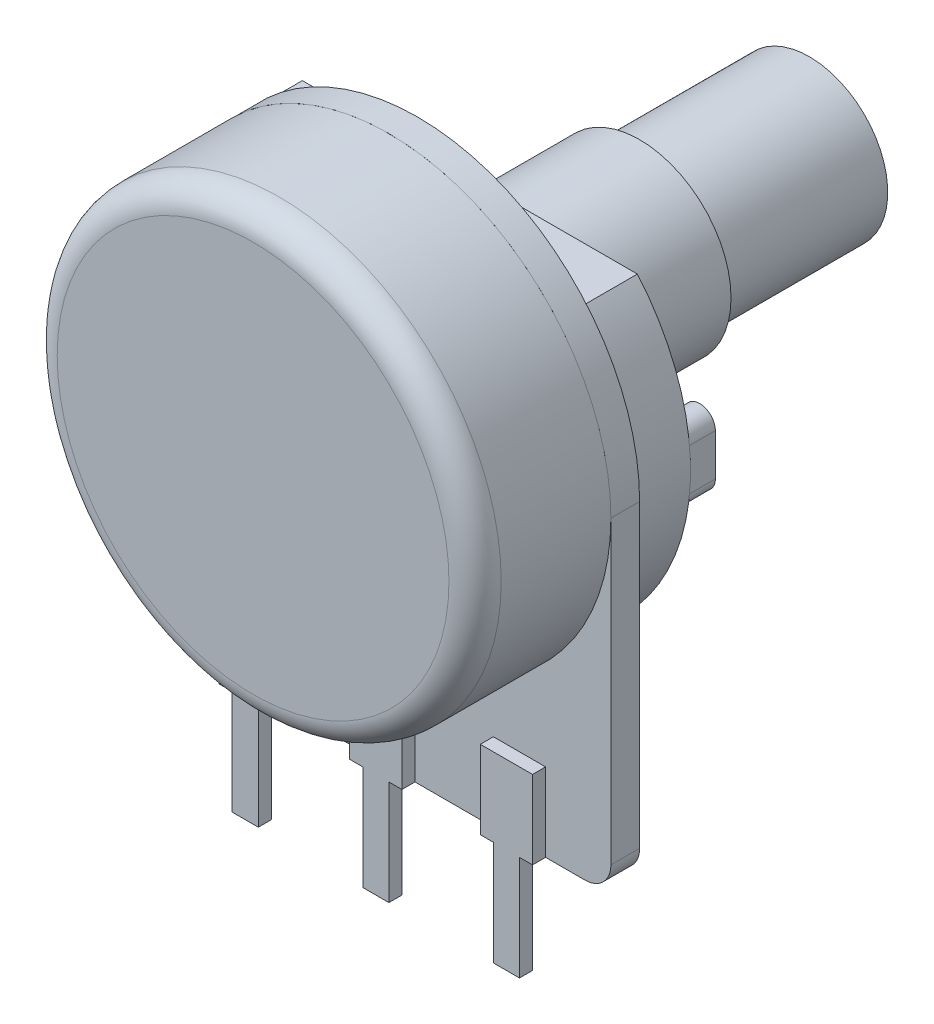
ISO-10303-21;
HEADER;
FILE_DESCRIPTION(('STEP AP214'),'2;1');
FILE_NAME('part.step','',(''),(''),'','','');
FILE_SCHEMA(('AUTOMOTIVE_DESIGN { 1 0 10303 214 1 1 1 1 }'));
ENDSEC;
DATA;
#1=APPLICATION_CONTEXT('core data for automotive mechanical design processes');
#2=APPLICATION_PROTOCOL_DEFINITION('international standard','automotive_design',2000,#1);
#3=PRODUCT_CONTEXT('',#1,'mechanical');
#4=PRODUCT('Part','Part','',(#3));
#5=PRODUCT_RELATED_PRODUCT_CATEGORY('part','',(#4));
#6=PRODUCT_DEFINITION_FORMATION('','',#4);
#7=PRODUCT_DEFINITION_CONTEXT('part definition',#1,'design');
#8=PRODUCT_DEFINITION('design','',#6,#7);
#9=PRODUCT_DEFINITION_SHAPE('','',#8);
#10=(LENGTH_UNIT() NAMED_UNIT(*) SI_UNIT(.MILLI.,.METRE.));
#11=(NAMED_UNIT(*) PLANE_ANGLE_UNIT() SI_UNIT($,.RADIAN.));
#12=(NAMED_UNIT(*) SI_UNIT($,.STERADIAN.) SOLID_ANGLE_UNIT());
#13=UNCERTAINTY_MEASURE_WITH_UNIT(LENGTH_MEASURE(1.E-05),#10,'distance_accuracy_value','');
#14=(GEOMETRIC_REPRESENTATION_CONTEXT(3) GLOBAL_UNCERTAINTY_ASSIGNED_CONTEXT((#13)) GLOBAL_UNIT_ASSIGNED_CONTEXT((#10,
#11,#12)) REPRESENTATION_CONTEXT('',''));
#15=CARTESIAN_POINT('',(0.,0.,0.));
#16=DIRECTION('',(0.,0.,1.));
#17=DIRECTION('',(1.,0.,0.));
#18=AXIS2_PLACEMENT_3D('',#15,#16,#17);
#19=CARTESIAN_POINT('',(4.,-9.49999999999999,0.5));
#20=DIRECTION('',(1.,0.,0.));
#21=DIRECTION('',(0.,1.,0.));
#22=AXIS2_PLACEMENT_3D('',#19,#20,#21);
#23=PLANE('',#22);
#24=DIRECTION('',(0.,-1.,0.));
#25=VECTOR('',#24,1.);
#26=CARTESIAN_POINT('',(4.,-9.49999999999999,0.));
#27=LINE('',#26,#25);
#28=CARTESIAN_POINT('',(4.,-9.49999999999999,0.));
#29=VERTEX_POINT('',#28);
#30=CARTESIAN_POINT('',(4.,-12.5,0.));
#31=VERTEX_POINT('',#30);
#32=EDGE_CURVE('E142',#29,#31,#27,.T.);
#33=ORIENTED_EDGE('',*,*,#32,.T.);
#34=DIRECTION('',(0.,0.,-1.));
#35=VECTOR('',#34,1.);
#36=CARTESIAN_POINT('',(4.,-12.5,0.5));
#37=LINE('',#36,#35);
#38=CARTESIAN_POINT('',(4.,-12.5,0.5));
#39=VERTEX_POINT('',#38);
#40=EDGE_CURVE('E12',#39,#31,#37,.T.);
#41=ORIENTED_EDGE('',*,*,#40,.F.);
#42=DIRECTION('',(0.,-1.,0.));
#43=VECTOR('',#42,1.);
#44=CARTESIAN_POINT('',(4.,-9.49999999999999,0.5));
#45=LINE('',#44,#43);
#46=CARTESIAN_POINT('',(4.,-9.49999999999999,0.5));
#47=VERTEX_POINT('',#46);
#48=EDGE_CURVE('E156',#47,#39,#45,.T.);
#49=ORIENTED_EDGE('',*,*,#48,.F.);
#50=DIRECTION('',(0.,0.,-1.));
#51=VECTOR('',#50,1.);
#52=CARTESIAN_POINT('',(4.,-9.49999999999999,0.5));
#53=LINE('',#52,#51);
#54=EDGE_CURVE('E138',#47,#29,#53,.T.);
#55=ORIENTED_EDGE('',*,*,#54,.T.);
#56=EDGE_LOOP('',(#33,#41,#49,#55));
#57=FACE_BOUND('',#56,.T.);
#58=ADVANCED_FACE('F46',(#57),#23,.F.);
#59=CARTESIAN_POINT('',(4.,-12.5,0.5));
#60=DIRECTION('',(0.,1.,0.));
#61=DIRECTION('',(-1.,0.,0.));
#62=AXIS2_PLACEMENT_3D('',#59,#60,#61);
#63=PLANE('',#62);
#64=DIRECTION('',(1.,0.,0.));
#65=VECTOR('',#64,1.);
#66=CARTESIAN_POINT('',(4.,-12.5,0.));
#67=LINE('',#66,#65);
#68=CARTESIAN_POINT('',(4.5,-12.5,0.));
#69=VERTEX_POINT('',#68);
#70=EDGE_CURVE('E145',#31,#69,#67,.T.);
#71=ORIENTED_EDGE('',*,*,#70,.T.);
#72=DIRECTION('',(0.,0.,-1.));
#73=VECTOR('',#72,1.);
#74=CARTESIAN_POINT('',(4.5,-12.5,0.5));
#75=LINE('',#74,#73);
#76=CARTESIAN_POINT('',(4.5,-12.5,0.5));
#77=VERTEX_POINT('',#76);
#78=EDGE_CURVE('E54',#77,#69,#75,.T.);
#79=ORIENTED_EDGE('',*,*,#78,.F.);
#80=DIRECTION('',(1.,0.,0.));
#81=VECTOR('',#80,1.);
#82=CARTESIAN_POINT('',(4.,-12.5,0.5));
#83=LINE('',#82,#81);
#84=EDGE_CURVE('E105',#39,#77,#83,.T.);
#85=ORIENTED_EDGE('',*,*,#84,.F.);
#86=ORIENTED_EDGE('',*,*,#40,.T.);
#87=EDGE_LOOP('',(#71,#79,#85,#86));
#88=FACE_BOUND('',#87,.T.);
#89=ADVANCED_FACE('F191',(#88),#63,.F.);
#90=CARTESIAN_POINT('',(4.5,-12.5,0.5));
#91=DIRECTION('',(1.,0.,0.));
#92=DIRECTION('',(0.,1.,0.));
#93=AXIS2_PLACEMENT_3D('',#90,#91,#92);
#94=PLANE('',#93);
#95=DIRECTION('',(0.,-1.,0.));
#96=VECTOR('',#95,1.);
#97=CARTESIAN_POINT('',(4.5,-12.5,0.));
#98=LINE('',#97,#96);
#99=CARTESIAN_POINT('',(4.5,-16.5,0.));
#100=VERTEX_POINT('',#99);
#101=EDGE_CURVE('E147',#69,#100,#98,.T.);
#102=ORIENTED_EDGE('',*,*,#101,.T.);
#103=DIRECTION('',(0.,0.,-1.));
#104=VECTOR('',#103,1.);
#105=CARTESIAN_POINT('',(4.5,-16.5,0.5));
#106=LINE('',#105,#104);
#107=CARTESIAN_POINT('',(4.5,-16.5,0.5));
#108=VERTEX_POINT('',#107);
#109=EDGE_CURVE('E163',#108,#100,#106,.T.);
#110=ORIENTED_EDGE('',*,*,#109,.F.);
#111=DIRECTION('',(0.,-1.,0.));
#112=VECTOR('',#111,1.);
#113=CARTESIAN_POINT('',(4.5,-12.5,0.5));
#114=LINE('',#113,#112);
#115=EDGE_CURVE('E171',#77,#108,#114,.T.);
#116=ORIENTED_EDGE('',*,*,#115,.F.);
#117=ORIENTED_EDGE('',*,*,#78,.T.);
#118=EDGE_LOOP('',(#102,#110,#116,#117));
#119=FACE_BOUND('',#118,.T.);
#120=ADVANCED_FACE('F169',(#119),#94,.F.);
#121=CARTESIAN_POINT('',(5.5,-16.5,0.5));
#122=DIRECTION('',(0.,1.,0.));
#123=DIRECTION('',(0.,0.,1.));
#124=AXIS2_PLACEMENT_3D('',#121,#122,#123);
#125=PLANE('',#124);
#126=DIRECTION('',(1.,0.,0.));
#127=VECTOR('',#126,1.);
#128=CARTESIAN_POINT('',(5.5,-16.5,0.));
#129=LINE('',#128,#127);
#130=CARTESIAN_POINT('',(5.5,-16.5,0.));
#131=VERTEX_POINT('',#130);
#132=EDGE_CURVE('E149',#100,#131,#129,.T.);
#133=ORIENTED_EDGE('',*,*,#132,.T.);
#134=DIRECTION('',(0.,0.,-1.));
#135=VECTOR('',#134,1.);
#136=CARTESIAN_POINT('',(5.5,-16.5,0.5));
#137=LINE('',#136,#135);
#138=CARTESIAN_POINT('',(5.5,-16.5,0.5));
#139=VERTEX_POINT('',#138);
#140=EDGE_CURVE('E160',#139,#131,#137,.T.);
#141=ORIENTED_EDGE('',*,*,#140,.F.);
#142=DIRECTION('',(1.,0.,0.));
#143=VECTOR('',#142,1.);
#144=CARTESIAN_POINT('',(5.5,-16.5,0.5));
#145=LINE('',#144,#143);
#146=EDGE_CURVE('E183',#108,#139,#145,.T.);
#147=ORIENTED_EDGE('',*,*,#146,.F.);
#148=ORIENTED_EDGE('',*,*,#109,.T.);
#149=EDGE_LOOP('',(#133,#141,#147,#148));
#150=FACE_BOUND('',#149,.T.);
#151=ADVANCED_FACE('F179',(#150),#125,.F.);
#152=CARTESIAN_POINT('',(5.5,-12.5,0.5));
#153=DIRECTION('',(-1.,0.,0.));
#154=DIRECTION('',(0.,-1.,0.));
#155=AXIS2_PLACEMENT_3D('',#152,#153,#154);
#156=PLANE('',#155);
#157=DIRECTION('',(0.,1.,0.));
#158=VECTOR('',#157,1.);
#159=CARTESIAN_POINT('',(5.5,-12.5,0.));
#160=LINE('',#159,#158);
#161=CARTESIAN_POINT('',(5.5,-12.5,0.));
#162=VERTEX_POINT('',#161);
#163=EDGE_CURVE('E151',#131,#162,#160,.T.);
#164=ORIENTED_EDGE('',*,*,#163,.T.);
#165=DIRECTION('',(0.,0.,-1.));
#166=VECTOR('',#165,1.);
#167=CARTESIAN_POINT('',(5.5,-12.5,0.5));
#168=LINE('',#167,#166);
#169=CARTESIAN_POINT('',(5.5,-12.5,0.5));
#170=VERTEX_POINT('',#169);
#171=EDGE_CURVE('E133',#170,#162,#168,.T.);
#172=ORIENTED_EDGE('',*,*,#171,.F.);
#173=DIRECTION('',(0.,1.,0.));
#174=VECTOR('',#173,1.);
#175=CARTESIAN_POINT('',(5.5,-12.5,0.5));
#176=LINE('',#175,#174);
#177=EDGE_CURVE('E124',#139,#170,#176,.T.);
#178=ORIENTED_EDGE('',*,*,#177,.F.);
#179=ORIENTED_EDGE('',*,*,#140,.T.);
#180=EDGE_LOOP('',(#164,#172,#178,#179));
#181=FACE_BOUND('',#180,.T.);
#182=ADVANCED_FACE('F182',(#181),#156,.F.);
#183=CARTESIAN_POINT('',(6.,-12.5,0.5));
#184=DIRECTION('',(0.,1.,0.));
#185=DIRECTION('',(-1.,0.,0.));
#186=AXIS2_PLACEMENT_3D('',#183,#184,#185);
#187=PLANE('',#186);
#188=DIRECTION('',(1.,0.,0.));
#189=VECTOR('',#188,1.);
#190=CARTESIAN_POINT('',(6.,-12.5,0.));
#191=LINE('',#190,#189);
#192=CARTESIAN_POINT('',(6.,-12.5,0.));
#193=VERTEX_POINT('',#192);
#194=EDGE_CURVE('E132',#162,#193,#191,.T.);
#195=ORIENTED_EDGE('',*,*,#194,.T.);
#196=DIRECTION('',(0.,0.,-1.));
#197=VECTOR('',#196,1.);
#198=CARTESIAN_POINT('',(6.,-12.5,0.5));
#199=LINE('',#198,#197);
#200=CARTESIAN_POINT('',(6.,-12.5,0.5));
#201=VERTEX_POINT('',#200);
#202=EDGE_CURVE('E129',#201,#193,#199,.T.);
#203=ORIENTED_EDGE('',*,*,#202,.F.);
#204=DIRECTION('',(1.,0.,0.));
#205=VECTOR('',#204,1.);
#206=CARTESIAN_POINT('',(6.,-12.5,0.5));
#207=LINE('',#206,#205);
#208=EDGE_CURVE('E118',#170,#201,#207,.T.);
#209=ORIENTED_EDGE('',*,*,#208,.F.);
#210=ORIENTED_EDGE('',*,*,#171,.T.);
#211=EDGE_LOOP('',(#195,#203,#209,#210));
#212=FACE_BOUND('',#211,.T.);
#213=ADVANCED_FACE('F130',(#212),#187,.F.);
#214=CARTESIAN_POINT('',(6.,-9.49999999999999,0.5));
#215=DIRECTION('',(-1.,0.,0.));
#216=DIRECTION('',(0.,-1.,0.));
#217=AXIS2_PLACEMENT_3D('',#214,#215,#216);
#218=PLANE('',#217);
#219=DIRECTION('',(0.,1.,0.));
#220=VECTOR('',#219,1.);
#221=CARTESIAN_POINT('',(6.,-9.49999999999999,0.));
#222=LINE('',#221,#220);
#223=CARTESIAN_POINT('',(6.,-9.49999999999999,0.));
#224=VERTEX_POINT('',#223);
#225=EDGE_CURVE('E91',#193,#224,#222,.T.);
#226=ORIENTED_EDGE('',*,*,#225,.T.);
#227=DIRECTION('',(0.,0.,-1.));
#228=VECTOR('',#227,1.);
#229=CARTESIAN_POINT('',(6.,-9.49999999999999,0.5));
#230=LINE('',#229,#228);
#231=CARTESIAN_POINT('',(6.,-9.49999999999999,0.5));
#232=VERTEX_POINT('',#231);
#233=EDGE_CURVE('E134',#232,#224,#230,.T.);
#234=ORIENTED_EDGE('',*,*,#233,.F.);
#235=DIRECTION('',(0.,1.,0.));
#236=VECTOR('',#235,1.);
#237=CARTESIAN_POINT('',(6.,-9.49999999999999,0.5));
#238=LINE('',#237,#236);
#239=EDGE_CURVE('E122',#201,#232,#238,.T.);
#240=ORIENTED_EDGE('',*,*,#239,.F.);
#241=ORIENTED_EDGE('',*,*,#202,.T.);
#242=EDGE_LOOP('',(#226,#234,#240,#241));
#243=FACE_BOUND('',#242,.T.);
#244=ADVANCED_FACE('F136',(#243),#218,.F.);
#245=CARTESIAN_POINT('',(6.,-9.49999999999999,0.5));
#246=DIRECTION('',(0.,-1.,0.));
#247=DIRECTION('',(0.,0.,-1.));
#248=AXIS2_PLACEMENT_3D('',#245,#246,#247);
#249=PLANE('',#248);
#250=DIRECTION('',(-1.,0.,0.));
#251=VECTOR('',#250,1.);
#252=CARTESIAN_POINT('',(6.,-9.49999999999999,0.));
#253=LINE('',#252,#251);
#254=EDGE_CURVE('E97',#224,#29,#253,.T.);
#255=ORIENTED_EDGE('',*,*,#254,.T.);
#256=ORIENTED_EDGE('',*,*,#54,.F.);
#257=DIRECTION('',(-1.,0.,0.));
#258=VECTOR('',#257,1.);
#259=CARTESIAN_POINT('',(6.,-9.49999999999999,0.5));
#260=LINE('',#259,#258);
#261=EDGE_CURVE('E62',#232,#47,#260,.T.);
#262=ORIENTED_EDGE('',*,*,#261,.F.);
#263=ORIENTED_EDGE('',*,*,#233,.T.);
#264=EDGE_LOOP('',(#255,#256,#262,#263));
#265=FACE_BOUND('',#264,.T.);
#266=ADVANCED_FACE('F207',(#265),#249,.F.);
#267=CARTESIAN_POINT('',(4.,-16.5,0.5));
#268=DIRECTION('',(0.,0.,-1.));
#269=DIRECTION('',(-1.,0.,0.));
#270=AXIS2_PLACEMENT_3D('',#267,#268,#269);
#271=PLANE('',#270);
#272=ORIENTED_EDGE('',*,*,#48,.T.);
#273=ORIENTED_EDGE('',*,*,#84,.T.);
#274=ORIENTED_EDGE('',*,*,#115,.T.);
#275=ORIENTED_EDGE('',*,*,#146,.T.);
#276=ORIENTED_EDGE('',*,*,#177,.T.);
#277=ORIENTED_EDGE('',*,*,#208,.T.);
#278=ORIENTED_EDGE('',*,*,#239,.T.);
#279=ORIENTED_EDGE('',*,*,#261,.T.);
#280=EDGE_LOOP('',(#272,#273,#274,#275,#276,#277,#278,#279));
#281=FACE_BOUND('',#280,.T.);
#282=ADVANCED_FACE('F120',(#281),#271,.F.);
#283=CARTESIAN_POINT('',(4.,-16.5,0.));
#284=DIRECTION('',(0.,0.,-1.));
#285=DIRECTION('',(-1.,0.,0.));
#286=AXIS2_PLACEMENT_3D('',#283,#284,#285);
#287=PLANE('',#286);
#288=ORIENTED_EDGE('',*,*,#32,.F.);
#289=ORIENTED_EDGE('',*,*,#254,.F.);
#290=ORIENTED_EDGE('',*,*,#225,.F.);
#291=ORIENTED_EDGE('',*,*,#194,.F.);
#292=ORIENTED_EDGE('',*,*,#163,.F.);
#293=ORIENTED_EDGE('',*,*,#132,.F.);
#294=ORIENTED_EDGE('',*,*,#101,.F.);
#295=ORIENTED_EDGE('',*,*,#70,.F.);
#296=EDGE_LOOP('',(#288,#289,#290,#291,#292,#293,#294,#295));
#297=FACE_BOUND('',#296,.T.);
#298=ADVANCED_FACE('F175',(#297),#287,.T.);
#299=CLOSED_SHELL('',(#58,#89,#120,#151,#182,#213,#244,#266,#282,#298));
#300=MANIFOLD_SOLID_BREP('B2',#299);
#301=CARTESIAN_POINT('',(-6.,-9.49999999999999,0.5));
#302=DIRECTION('',(1.,0.,0.));
#303=DIRECTION('',(0.,1.,0.));
#304=AXIS2_PLACEMENT_3D('',#301,#302,#303);
#305=PLANE('',#304);
#306=DIRECTION('',(0.,-1.,0.));
#307=VECTOR('',#306,1.);
#308=CARTESIAN_POINT('',(-6.,-9.49999999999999,0.));
#309=LINE('',#308,#307);
#310=CARTESIAN_POINT('',(-6.,-9.49999999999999,0.));
#311=VERTEX_POINT('',#310);
#312=CARTESIAN_POINT('',(-6.,-12.5,0.));
#313=VERTEX_POINT('',#312);
#314=EDGE_CURVE('E380',#311,#313,#309,.T.);
#315=ORIENTED_EDGE('',*,*,#314,.T.);
#316=DIRECTION('',(0.,0.,-1.));
#317=VECTOR('',#316,1.);
#318=CARTESIAN_POINT('',(-6.,-12.5,0.5));
#319=LINE('',#318,#317);
#320=CARTESIAN_POINT('',(-6.,-12.5,0.5));
#321=VERTEX_POINT('',#320);
#322=EDGE_CURVE('E44',#321,#313,#319,.T.);
#323=ORIENTED_EDGE('',*,*,#322,.F.);
#324=DIRECTION('',(0.,-1.,0.));
#325=VECTOR('',#324,1.);
#326=CARTESIAN_POINT('',(-6.,-9.49999999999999,0.5));
#327=LINE('',#326,#325);
#328=CARTESIAN_POINT('',(-6.,-9.49999999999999,0.5));
#329=VERTEX_POINT('',#328);
#330=EDGE_CURVE('E394',#329,#321,#327,.T.);
#331=ORIENTED_EDGE('',*,*,#330,.F.);
#332=DIRECTION('',(0.,0.,-1.));
#333=VECTOR('',#332,1.);
#334=CARTESIAN_POINT('',(-6.,-9.49999999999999,0.5));
#335=LINE('',#334,#333);
#336=EDGE_CURVE('E376',#329,#311,#335,.T.);
#337=ORIENTED_EDGE('',*,*,#336,.T.);
#338=EDGE_LOOP('',(#315,#323,#331,#337));
#339=FACE_BOUND('',#338,.T.);
#340=ADVANCED_FACE('F284',(#339),#305,.F.);
#341=CARTESIAN_POINT('',(-6.,-12.5,0.5));
#342=DIRECTION('',(0.,1.,0.));
#343=DIRECTION('',(-1.,0.,0.));
#344=AXIS2_PLACEMENT_3D('',#341,#342,#343);
#345=PLANE('',#344);
#346=DIRECTION('',(1.,0.,0.));
#347=VECTOR('',#346,1.);
#348=CARTESIAN_POINT('',(-6.,-12.5,0.));
#349=LINE('',#348,#347);
#350=CARTESIAN_POINT('',(-5.5,-12.5,0.));
#351=VERTEX_POINT('',#350);
#352=EDGE_CURVE('E383',#313,#351,#349,.T.);
#353=ORIENTED_EDGE('',*,*,#352,.T.);
#354=DIRECTION('',(0.,0.,-1.));
#355=VECTOR('',#354,1.);
#356=CARTESIAN_POINT('',(-5.5,-12.5,0.5));
#357=LINE('',#356,#355);
#358=CARTESIAN_POINT('',(-5.5,-12.5,0.5));
#359=VERTEX_POINT('',#358);
#360=EDGE_CURVE('E292',#359,#351,#357,.T.);
#361=ORIENTED_EDGE('',*,*,#360,.F.);
#362=DIRECTION('',(1.,0.,0.));
#363=VECTOR('',#362,1.);
#364=CARTESIAN_POINT('',(-6.,-12.5,0.5));
#365=LINE('',#364,#363);
#366=EDGE_CURVE('E343',#321,#359,#365,.T.);
#367=ORIENTED_EDGE('',*,*,#366,.F.);
#368=ORIENTED_EDGE('',*,*,#322,.T.);
#369=EDGE_LOOP('',(#353,#361,#367,#368));
#370=FACE_BOUND('',#369,.T.);
#371=ADVANCED_FACE('F429',(#370),#345,.F.);
#372=CARTESIAN_POINT('',(-5.5,-12.5,0.5));
#373=DIRECTION('',(1.,0.,0.));
#374=DIRECTION('',(0.,1.,0.));
#375=AXIS2_PLACEMENT_3D('',#372,#373,#374);
#376=PLANE('',#375);
#377=DIRECTION('',(0.,-1.,0.));
#378=VECTOR('',#377,1.);
#379=CARTESIAN_POINT('',(-5.5,-12.5,0.));
#380=LINE('',#379,#378);
#381=CARTESIAN_POINT('',(-5.5,-16.5,0.));
#382=VERTEX_POINT('',#381);
#383=EDGE_CURVE('E385',#351,#382,#380,.T.);
#384=ORIENTED_EDGE('',*,*,#383,.T.);
#385=DIRECTION('',(0.,0.,-1.));
#386=VECTOR('',#385,1.);
#387=CARTESIAN_POINT('',(-5.5,-16.5,0.5));
#388=LINE('',#387,#386);
#389=CARTESIAN_POINT('',(-5.5,-16.5,0.5));
#390=VERTEX_POINT('',#389);
#391=EDGE_CURVE('E401',#390,#382,#388,.T.);
#392=ORIENTED_EDGE('',*,*,#391,.F.);
#393=DIRECTION('',(0.,-1.,0.));
#394=VECTOR('',#393,1.);
#395=CARTESIAN_POINT('',(-5.5,-12.5,0.5));
#396=LINE('',#395,#394);
#397=EDGE_CURVE('E409',#359,#390,#396,.T.);
#398=ORIENTED_EDGE('',*,*,#397,.F.);
#399=ORIENTED_EDGE('',*,*,#360,.T.);
#400=EDGE_LOOP('',(#384,#392,#398,#399));
#401=FACE_BOUND('',#400,.T.);
#402=ADVANCED_FACE('F407',(#401),#376,.F.);
#403=CARTESIAN_POINT('',(-5.5,-16.5,0.5));
#404=DIRECTION('',(0.,1.,0.));
#405=DIRECTION('',(0.,0.,1.));
#406=AXIS2_PLACEMENT_3D('',#403,#404,#405);
#407=PLANE('',#406);
#408=DIRECTION('',(1.,0.,0.));
#409=VECTOR('',#408,1.);
#410=CARTESIAN_POINT('',(-5.5,-16.5,0.));
#411=LINE('',#410,#409);
#412=CARTESIAN_POINT('',(-4.5,-16.5,0.));
#413=VERTEX_POINT('',#412);
#414=EDGE_CURVE('E387',#382,#413,#411,.T.);
#415=ORIENTED_EDGE('',*,*,#414,.T.);
#416=DIRECTION('',(0.,0.,-1.));
#417=VECTOR('',#416,1.);
#418=CARTESIAN_POINT('',(-4.5,-16.5,0.5));
#419=LINE('',#418,#417);
#420=CARTESIAN_POINT('',(-4.5,-16.5,0.5));
#421=VERTEX_POINT('',#420);
#422=EDGE_CURVE('E398',#421,#413,#419,.T.);
#423=ORIENTED_EDGE('',*,*,#422,.F.);
#424=DIRECTION('',(1.,0.,0.));
#425=VECTOR('',#424,1.);
#426=CARTESIAN_POINT('',(-5.5,-16.5,0.5));
#427=LINE('',#426,#425);
#428=EDGE_CURVE('E421',#390,#421,#427,.T.);
#429=ORIENTED_EDGE('',*,*,#428,.F.);
#430=ORIENTED_EDGE('',*,*,#391,.T.);
#431=EDGE_LOOP('',(#415,#423,#429,#430));
#432=FACE_BOUND('',#431,.T.);
#433=ADVANCED_FACE('F417',(#432),#407,.F.);
#434=CARTESIAN_POINT('',(-4.5,-12.5,0.5));
#435=DIRECTION('',(-1.,0.,0.));
#436=DIRECTION('',(0.,-1.,0.));
#437=AXIS2_PLACEMENT_3D('',#434,#435,#436);
#438=PLANE('',#437);
#439=DIRECTION('',(0.,1.,0.));
#440=VECTOR('',#439,1.);
#441=CARTESIAN_POINT('',(-4.5,-12.5,0.));
#442=LINE('',#441,#440);
#443=CARTESIAN_POINT('',(-4.5,-12.5,0.));
#444=VERTEX_POINT('',#443);
#445=EDGE_CURVE('E389',#413,#444,#442,.T.);
#446=ORIENTED_EDGE('',*,*,#445,.T.);
#447=DIRECTION('',(0.,0.,-1.));
#448=VECTOR('',#447,1.);
#449=CARTESIAN_POINT('',(-4.5,-12.5,0.5));
#450=LINE('',#449,#448);
#451=CARTESIAN_POINT('',(-4.5,-12.5,0.5));
#452=VERTEX_POINT('',#451);
#453=EDGE_CURVE('E371',#452,#444,#450,.T.);
#454=ORIENTED_EDGE('',*,*,#453,.F.);
#455=DIRECTION('',(0.,1.,0.));
#456=VECTOR('',#455,1.);
#457=CARTESIAN_POINT('',(-4.5,-12.5,0.5));
#458=LINE('',#457,#456);
#459=EDGE_CURVE('E362',#421,#452,#458,.T.);
#460=ORIENTED_EDGE('',*,*,#459,.F.);
#461=ORIENTED_EDGE('',*,*,#422,.T.);
#462=EDGE_LOOP('',(#446,#454,#460,#461));
#463=FACE_BOUND('',#462,.T.);
#464=ADVANCED_FACE('F420',(#463),#438,.F.);
#465=CARTESIAN_POINT('',(-4.,-12.5,0.5));
#466=DIRECTION('',(0.,1.,0.));
#467=DIRECTION('',(-1.,0.,0.));
#468=AXIS2_PLACEMENT_3D('',#465,#466,#467);
#469=PLANE('',#468);
#470=DIRECTION('',(1.,0.,0.));
#471=VECTOR('',#470,1.);
#472=CARTESIAN_POINT('',(-4.,-12.5,0.));
#473=LINE('',#472,#471);
#474=CARTESIAN_POINT('',(-4.,-12.5,0.));
#475=VERTEX_POINT('',#474);
#476=EDGE_CURVE('E370',#444,#475,#473,.T.);
#477=ORIENTED_EDGE('',*,*,#476,.T.);
#478=DIRECTION('',(0.,0.,-1.));
#479=VECTOR('',#478,1.);
#480=CARTESIAN_POINT('',(-4.,-12.5,0.5));
#481=LINE('',#480,#479);
#482=CARTESIAN_POINT('',(-4.,-12.5,0.5));
#483=VERTEX_POINT('',#482);
#484=EDGE_CURVE('E367',#483,#475,#481,.T.);
#485=ORIENTED_EDGE('',*,*,#484,.F.);
#486=DIRECTION('',(1.,0.,0.));
#487=VECTOR('',#486,1.);
#488=CARTESIAN_POINT('',(-4.,-12.5,0.5));
#489=LINE('',#488,#487);
#490=EDGE_CURVE('E356',#452,#483,#489,.T.);
#491=ORIENTED_EDGE('',*,*,#490,.F.);
#492=ORIENTED_EDGE('',*,*,#453,.T.);
#493=EDGE_LOOP('',(#477,#485,#491,#492));
#494=FACE_BOUND('',#493,.T.);
#495=ADVANCED_FACE('F368',(#494),#469,.F.);
#496=CARTESIAN_POINT('',(-4.,-9.49999999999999,0.5));
#497=DIRECTION('',(-1.,0.,0.));
#498=DIRECTION('',(0.,-1.,0.));
#499=AXIS2_PLACEMENT_3D('',#496,#497,#498);
#500=PLANE('',#499);
#501=DIRECTION('',(0.,1.,0.));
#502=VECTOR('',#501,1.);
#503=CARTESIAN_POINT('',(-4.,-9.49999999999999,0.));
#504=LINE('',#503,#502);
#505=CARTESIAN_POINT('',(-4.,-9.49999999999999,0.));
#506=VERTEX_POINT('',#505);
#507=EDGE_CURVE('E329',#475,#506,#504,.T.);
#508=ORIENTED_EDGE('',*,*,#507,.T.);
#509=DIRECTION('',(0.,0.,-1.));
#510=VECTOR('',#509,1.);
#511=CARTESIAN_POINT('',(-4.,-9.49999999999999,0.5));
#512=LINE('',#511,#510);
#513=CARTESIAN_POINT('',(-4.,-9.49999999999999,0.5));
#514=VERTEX_POINT('',#513);
#515=EDGE_CURVE('E372',#514,#506,#512,.T.);
#516=ORIENTED_EDGE('',*,*,#515,.F.);
#517=DIRECTION('',(0.,1.,0.));
#518=VECTOR('',#517,1.);
#519=CARTESIAN_POINT('',(-4.,-9.49999999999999,0.5));
#520=LINE('',#519,#518);
#521=EDGE_CURVE('E360',#483,#514,#520,.T.);
#522=ORIENTED_EDGE('',*,*,#521,.F.);
#523=ORIENTED_EDGE('',*,*,#484,.T.);
#524=EDGE_LOOP('',(#508,#516,#522,#523));
#525=FACE_BOUND('',#524,.T.);
#526=ADVANCED_FACE('F374',(#525),#500,.F.);
#527=CARTESIAN_POINT('',(-6.,-9.49999999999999,0.5));
#528=DIRECTION('',(0.,-1.,0.));
#529=DIRECTION('',(0.,0.,-1.));
#530=AXIS2_PLACEMENT_3D('',#527,#528,#529);
#531=PLANE('',#530);
#532=DIRECTION('',(-1.,0.,0.));
#533=VECTOR('',#532,1.);
#534=CARTESIAN_POINT('',(-6.,-9.49999999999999,0.));
#535=LINE('',#534,#533);
#536=EDGE_CURVE('E335',#506,#311,#535,.T.);
#537=ORIENTED_EDGE('',*,*,#536,.T.);
#538=ORIENTED_EDGE('',*,*,#336,.F.);
#539=DIRECTION('',(-1.,0.,0.));
#540=VECTOR('',#539,1.);
#541=CARTESIAN_POINT('',(-6.,-9.49999999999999,0.5));
#542=LINE('',#541,#540);
#543=EDGE_CURVE('E300',#514,#329,#542,.T.);
#544=ORIENTED_EDGE('',*,*,#543,.F.);
#545=ORIENTED_EDGE('',*,*,#515,.T.);
#546=EDGE_LOOP('',(#537,#538,#544,#545));
#547=FACE_BOUND('',#546,.T.);
#548=ADVANCED_FACE('F445',(#547),#531,.F.);
#549=CARTESIAN_POINT('',(-6.,-16.5,0.5));
#550=DIRECTION('',(0.,0.,1.));
#551=DIRECTION('',(1.,0.,0.));
#552=AXIS2_PLACEMENT_3D('',#549,#550,#551);
#553=PLANE('',#552);
#554=ORIENTED_EDGE('',*,*,#330,.T.);
#555=ORIENTED_EDGE('',*,*,#366,.T.);
#556=ORIENTED_EDGE('',*,*,#397,.T.);
#557=ORIENTED_EDGE('',*,*,#428,.T.);
#558=ORIENTED_EDGE('',*,*,#459,.T.);
#559=ORIENTED_EDGE('',*,*,#490,.T.);
#560=ORIENTED_EDGE('',*,*,#521,.T.);
#561=ORIENTED_EDGE('',*,*,#543,.T.);
#562=EDGE_LOOP('',(#554,#555,#556,#557,#558,#559,#560,#561));
#563=FACE_BOUND('',#562,.T.);
#564=ADVANCED_FACE('F358',(#563),#553,.T.);
#565=CARTESIAN_POINT('',(-6.,-16.5,0.));
#566=DIRECTION('',(0.,0.,1.));
#567=DIRECTION('',(1.,0.,0.));
#568=AXIS2_PLACEMENT_3D('',#565,#566,#567);
#569=PLANE('',#568);
#570=ORIENTED_EDGE('',*,*,#314,.F.);
#571=ORIENTED_EDGE('',*,*,#536,.F.);
#572=ORIENTED_EDGE('',*,*,#507,.F.);
#573=ORIENTED_EDGE('',*,*,#476,.F.);
#574=ORIENTED_EDGE('',*,*,#445,.F.);
#575=ORIENTED_EDGE('',*,*,#414,.F.);
#576=ORIENTED_EDGE('',*,*,#383,.F.);
#577=ORIENTED_EDGE('',*,*,#352,.F.);
#578=EDGE_LOOP('',(#570,#571,#572,#573,#574,#575,#576,#577));
#579=FACE_BOUND('',#578,.T.);
#580=ADVANCED_FACE('F413',(#579),#569,.F.);
#581=CLOSED_SHELL('',(#340,#371,#402,#433,#464,#495,#526,#548,#564,#580));
#582=MANIFOLD_SOLID_BREP('B6',#581);
#583=CARTESIAN_POINT('',(-0.999999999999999,-9.5,0.5));
#584=DIRECTION('',(0.,-1.,0.));
#585=DIRECTION('',(0.,0.,-1.));
#586=AXIS2_PLACEMENT_3D('',#583,#584,#585);
#587=PLANE('',#586);
#588=DIRECTION('',(-1.,0.,0.));
#589=VECTOR('',#588,1.);
#590=CARTESIAN_POINT('',(-0.999999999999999,-9.5,0.));
#591=LINE('',#590,#589);
#592=CARTESIAN_POINT('',(1.,-9.5,0.));
#593=VERTEX_POINT('',#592);
#594=CARTESIAN_POINT('',(-0.999999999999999,-9.5,0.));
#595=VERTEX_POINT('',#594);
#596=EDGE_CURVE('E618',#593,#595,#591,.T.);
#597=ORIENTED_EDGE('',*,*,#596,.T.);
#598=DIRECTION('',(0.,0.,-1.));
#599=VECTOR('',#598,1.);
#600=CARTESIAN_POINT('',(-0.999999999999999,-9.5,0.5));
#601=LINE('',#600,#599);
#602=CARTESIAN_POINT('',(-0.999999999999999,-9.5,0.5));
#603=VERTEX_POINT('',#602);
#604=EDGE_CURVE('E282',#603,#595,#601,.T.);
#605=ORIENTED_EDGE('',*,*,#604,.F.);
#606=DIRECTION('',(-1.,0.,0.));
#607=VECTOR('',#606,1.);
#608=CARTESIAN_POINT('',(-0.999999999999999,-9.5,0.5));
#609=LINE('',#608,#607);
#610=CARTESIAN_POINT('',(1.,-9.5,0.5));
#611=VERTEX_POINT('',#610);
#612=EDGE_CURVE('E632',#611,#603,#609,.T.);
#613=ORIENTED_EDGE('',*,*,#612,.F.);
#614=DIRECTION('',(0.,0.,-1.));
#615=VECTOR('',#614,1.);
#616=CARTESIAN_POINT('',(1.,-9.5,0.5));
#617=LINE('',#616,#615);
#618=EDGE_CURVE('E614',#611,#593,#617,.T.);
#619=ORIENTED_EDGE('',*,*,#618,.T.);
#620=EDGE_LOOP('',(#597,#605,#613,#619));
#621=FACE_BOUND('',#620,.T.);
#622=ADVANCED_FACE('F522',(#621),#587,.F.);
#623=CARTESIAN_POINT('',(-0.999999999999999,-9.5,0.5));
#624=DIRECTION('',(1.,0.,0.));
#625=DIRECTION('',(0.,1.,0.));
#626=AXIS2_PLACEMENT_3D('',#623,#624,#625);
#627=PLANE('',#626);
#628=DIRECTION('',(0.,-1.,0.));
#629=VECTOR('',#628,1.);
#630=CARTESIAN_POINT('',(-0.999999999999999,-9.5,0.));
#631=LINE('',#630,#629);
#632=CARTESIAN_POINT('',(-0.999999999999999,-12.5,0.));
#633=VERTEX_POINT('',#632);
#634=EDGE_CURVE('E621',#595,#633,#631,.T.);
#635=ORIENTED_EDGE('',*,*,#634,.T.);
#636=DIRECTION('',(0.,0.,-1.));
#637=VECTOR('',#636,1.);
#638=CARTESIAN_POINT('',(-0.999999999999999,-12.5,0.5));
#639=LINE('',#638,#637);
#640=CARTESIAN_POINT('',(-0.999999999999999,-12.5,0.5));
#641=VERTEX_POINT('',#640);
#642=EDGE_CURVE('E530',#641,#633,#639,.T.);
#643=ORIENTED_EDGE('',*,*,#642,.F.);
#644=DIRECTION('',(0.,-1.,0.));
#645=VECTOR('',#644,1.);
#646=CARTESIAN_POINT('',(-0.999999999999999,-9.5,0.5));
#647=LINE('',#646,#645);
#648=EDGE_CURVE('E581',#603,#641,#647,.T.);
#649=ORIENTED_EDGE('',*,*,#648,.F.);
#650=ORIENTED_EDGE('',*,*,#604,.T.);
#651=EDGE_LOOP('',(#635,#643,#649,#650));
#652=FACE_BOUND('',#651,.T.);
#653=ADVANCED_FACE('F667',(#652),#627,.F.);
#654=CARTESIAN_POINT('',(-0.999999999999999,-12.5,0.5));
#655=DIRECTION('',(0.,1.,0.));
#656=DIRECTION('',(-1.,0.,0.));
#657=AXIS2_PLACEMENT_3D('',#654,#655,#656);
#658=PLANE('',#657);
#659=DIRECTION('',(1.,0.,0.));
#660=VECTOR('',#659,1.);
#661=CARTESIAN_POINT('',(-0.999999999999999,-12.5,0.));
#662=LINE('',#661,#660);
#663=CARTESIAN_POINT('',(-0.499999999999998,-12.5,0.));
#664=VERTEX_POINT('',#663);
#665=EDGE_CURVE('E623',#633,#664,#662,.T.);
#666=ORIENTED_EDGE('',*,*,#665,.T.);
#667=DIRECTION('',(0.,0.,-1.));
#668=VECTOR('',#667,1.);
#669=CARTESIAN_POINT('',(-0.499999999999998,-12.5,0.5));
#670=LINE('',#669,#668);
#671=CARTESIAN_POINT('',(-0.499999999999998,-12.5,0.5));
#672=VERTEX_POINT('',#671);
#673=EDGE_CURVE('E639',#672,#664,#670,.T.);
#674=ORIENTED_EDGE('',*,*,#673,.F.);
#675=DIRECTION('',(1.,0.,0.));
#676=VECTOR('',#675,1.);
#677=CARTESIAN_POINT('',(-0.999999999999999,-12.5,0.5));
#678=LINE('',#677,#676);
#679=EDGE_CURVE('E647',#641,#672,#678,.T.);
#680=ORIENTED_EDGE('',*,*,#679,.F.);
#681=ORIENTED_EDGE('',*,*,#642,.T.);
#682=EDGE_LOOP('',(#666,#674,#680,#681));
#683=FACE_BOUND('',#682,.T.);
#684=ADVANCED_FACE('F645',(#683),#658,.F.);
#685=CARTESIAN_POINT('',(-0.499999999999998,-12.5,0.5));
#686=DIRECTION('',(1.,0.,0.));
#687=DIRECTION('',(0.,1.,0.));
#688=AXIS2_PLACEMENT_3D('',#685,#686,#687);
#689=PLANE('',#688);
#690=DIRECTION('',(0.,-1.,0.));
#691=VECTOR('',#690,1.);
#692=CARTESIAN_POINT('',(-0.499999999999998,-12.5,0.));
#693=LINE('',#692,#691);
#694=CARTESIAN_POINT('',(-0.499999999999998,-16.5,0.));
#695=VERTEX_POINT('',#694);
#696=EDGE_CURVE('E625',#664,#695,#693,.T.);
#697=ORIENTED_EDGE('',*,*,#696,.T.);
#698=DIRECTION('',(0.,0.,-1.));
#699=VECTOR('',#698,1.);
#700=CARTESIAN_POINT('',(-0.499999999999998,-16.5,0.5));
#701=LINE('',#700,#699);
#702=CARTESIAN_POINT('',(-0.499999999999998,-16.5,0.5));
#703=VERTEX_POINT('',#702);
#704=EDGE_CURVE('E636',#703,#695,#701,.T.);
#705=ORIENTED_EDGE('',*,*,#704,.F.);
#706=DIRECTION('',(0.,-1.,0.));
#707=VECTOR('',#706,1.);
#708=CARTESIAN_POINT('',(-0.499999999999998,-12.5,0.5));
#709=LINE('',#708,#707);
#710=EDGE_CURVE('E659',#672,#703,#709,.T.);
#711=ORIENTED_EDGE('',*,*,#710,.F.);
#712=ORIENTED_EDGE('',*,*,#673,.T.);
#713=EDGE_LOOP('',(#697,#705,#711,#712));
#714=FACE_BOUND('',#713,.T.);
#715=ADVANCED_FACE('F655',(#714),#689,.F.);
#716=CARTESIAN_POINT('',(-0.499999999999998,-16.5,0.5));
#717=DIRECTION('',(0.,1.,0.));
#718=DIRECTION('',(0.,0.,1.));
#719=AXIS2_PLACEMENT_3D('',#716,#717,#718);
#720=PLANE('',#719);
#721=DIRECTION('',(1.,0.,0.));
#722=VECTOR('',#721,1.);
#723=CARTESIAN_POINT('',(-0.499999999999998,-16.5,0.));
#724=LINE('',#723,#722);
#725=CARTESIAN_POINT('',(0.500000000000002,-16.5,0.));
#726=VERTEX_POINT('',#725);
#727=EDGE_CURVE('E627',#695,#726,#724,.T.);
#728=ORIENTED_EDGE('',*,*,#727,.T.);
#729=DIRECTION('',(0.,0.,-1.));
#730=VECTOR('',#729,1.);
#731=CARTESIAN_POINT('',(0.500000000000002,-16.5,0.5));
#732=LINE('',#731,#730);
#733=CARTESIAN_POINT('',(0.500000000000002,-16.5,0.5));
#734=VERTEX_POINT('',#733);
#735=EDGE_CURVE('E609',#734,#726,#732,.T.);
#736=ORIENTED_EDGE('',*,*,#735,.F.);
#737=DIRECTION('',(1.,0.,0.));
#738=VECTOR('',#737,1.);
#739=CARTESIAN_POINT('',(-0.499999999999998,-16.5,0.5));
#740=LINE('',#739,#738);
#741=EDGE_CURVE('E600',#703,#734,#740,.T.);
#742=ORIENTED_EDGE('',*,*,#741,.F.);
#743=ORIENTED_EDGE('',*,*,#704,.T.);
#744=EDGE_LOOP('',(#728,#736,#742,#743));
#745=FACE_BOUND('',#744,.T.);
#746=ADVANCED_FACE('F658',(#745),#720,.F.);
#747=CARTESIAN_POINT('',(0.500000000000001,-12.5,0.5));
#748=DIRECTION('',(-1.,0.,0.));
#749=DIRECTION('',(0.,-1.,0.));
#750=AXIS2_PLACEMENT_3D('',#747,#748,#749);
#751=PLANE('',#750);
#752=DIRECTION('',(0.,1.,0.));
#753=VECTOR('',#752,1.);
#754=CARTESIAN_POINT('',(0.500000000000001,-12.5,0.));
#755=LINE('',#754,#753);
#756=CARTESIAN_POINT('',(0.500000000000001,-12.5,0.));
#757=VERTEX_POINT('',#756);
#758=EDGE_CURVE('E608',#726,#757,#755,.T.);
#759=ORIENTED_EDGE('',*,*,#758,.T.);
#760=DIRECTION('',(0.,0.,-1.));
#761=VECTOR('',#760,1.);
#762=CARTESIAN_POINT('',(0.500000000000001,-12.5,0.5));
#763=LINE('',#762,#761);
#764=CARTESIAN_POINT('',(0.500000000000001,-12.5,0.5));
#765=VERTEX_POINT('',#764);
#766=EDGE_CURVE('E605',#765,#757,#763,.T.);
#767=ORIENTED_EDGE('',*,*,#766,.F.);
#768=DIRECTION('',(0.,1.,0.));
#769=VECTOR('',#768,1.);
#770=CARTESIAN_POINT('',(0.500000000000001,-12.5,0.5));
#771=LINE('',#770,#769);
#772=EDGE_CURVE('E594',#734,#765,#771,.T.);
#773=ORIENTED_EDGE('',*,*,#772,.F.);
#774=ORIENTED_EDGE('',*,*,#735,.T.);
#775=EDGE_LOOP('',(#759,#767,#773,#774));
#776=FACE_BOUND('',#775,.T.);
#777=ADVANCED_FACE('F606',(#776),#751,.F.);
#778=CARTESIAN_POINT('',(1.,-12.5,0.5));
#779=DIRECTION('',(0.,1.,0.));
#780=DIRECTION('',(-1.,0.,0.));
#781=AXIS2_PLACEMENT_3D('',#778,#779,#780);
#782=PLANE('',#781);
#783=DIRECTION('',(1.,0.,0.));
#784=VECTOR('',#783,1.);
#785=CARTESIAN_POINT('',(1.,-12.5,0.));
#786=LINE('',#785,#784);
#787=CARTESIAN_POINT('',(1.,-12.5,0.));
#788=VERTEX_POINT('',#787);
#789=EDGE_CURVE('E567',#757,#788,#786,.T.);
#790=ORIENTED_EDGE('',*,*,#789,.T.);
#791=DIRECTION('',(0.,0.,-1.));
#792=VECTOR('',#791,1.);
#793=CARTESIAN_POINT('',(1.,-12.5,0.5));
#794=LINE('',#793,#792);
#795=CARTESIAN_POINT('',(1.,-12.5,0.5));
#796=VERTEX_POINT('',#795);
#797=EDGE_CURVE('E610',#796,#788,#794,.T.);
#798=ORIENTED_EDGE('',*,*,#797,.F.);
#799=DIRECTION('',(1.,0.,0.));
#800=VECTOR('',#799,1.);
#801=CARTESIAN_POINT('',(1.,-12.5,0.5));
#802=LINE('',#801,#800);
#803=EDGE_CURVE('E598',#765,#796,#802,.T.);
#804=ORIENTED_EDGE('',*,*,#803,.F.);
#805=ORIENTED_EDGE('',*,*,#766,.T.);
#806=EDGE_LOOP('',(#790,#798,#804,#805));
#807=FACE_BOUND('',#806,.T.);
#808=ADVANCED_FACE('F612',(#807),#782,.F.);
#809=CARTESIAN_POINT('',(1.,-9.5,0.5));
#810=DIRECTION('',(-1.,0.,0.));
#811=DIRECTION('',(0.,-1.,0.));
#812=AXIS2_PLACEMENT_3D('',#809,#810,#811);
#813=PLANE('',#812);
#814=DIRECTION('',(0.,1.,0.));
#815=VECTOR('',#814,1.);
#816=CARTESIAN_POINT('',(1.,-9.5,0.));
#817=LINE('',#816,#815);
#818=EDGE_CURVE('E573',#788,#593,#817,.T.);
#819=ORIENTED_EDGE('',*,*,#818,.T.);
#820=ORIENTED_EDGE('',*,*,#618,.F.);
#821=DIRECTION('',(0.,1.,0.));
#822=VECTOR('',#821,1.);
#823=CARTESIAN_POINT('',(1.,-9.5,0.5));
#824=LINE('',#823,#822);
#825=EDGE_CURVE('E538',#796,#611,#824,.T.);
#826=ORIENTED_EDGE('',*,*,#825,.F.);
#827=ORIENTED_EDGE('',*,*,#797,.T.);
#828=EDGE_LOOP('',(#819,#820,#826,#827));
#829=FACE_BOUND('',#828,.T.);
#830=ADVANCED_FACE('F683',(#829),#813,.F.);
#831=CARTESIAN_POINT('',(-0.499999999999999,-9.5,0.5));
#832=DIRECTION('',(0.,0.,-1.));
#833=DIRECTION('',(-1.,0.,0.));
#834=AXIS2_PLACEMENT_3D('',#831,#832,#833);
#835=PLANE('',#834);
#836=ORIENTED_EDGE('',*,*,#612,.T.);
#837=ORIENTED_EDGE('',*,*,#648,.T.);
#838=ORIENTED_EDGE('',*,*,#679,.T.);
#839=ORIENTED_EDGE('',*,*,#710,.T.);
#840=ORIENTED_EDGE('',*,*,#741,.T.);
#841=ORIENTED_EDGE('',*,*,#772,.T.);
#842=ORIENTED_EDGE('',*,*,#803,.T.);
#843=ORIENTED_EDGE('',*,*,#825,.T.);
#844=EDGE_LOOP('',(#836,#837,#838,#839,#840,#841,#842,#843));
#845=FACE_BOUND('',#844,.T.);
#846=ADVANCED_FACE('F596',(#845),#835,.F.);
#847=CARTESIAN_POINT('',(-0.499999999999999,-9.5,0.));
#848=DIRECTION('',(0.,0.,-1.));
#849=DIRECTION('',(-1.,0.,0.));
#850=AXIS2_PLACEMENT_3D('',#847,#848,#849);
#851=PLANE('',#850);
#852=ORIENTED_EDGE('',*,*,#596,.F.);
#853=ORIENTED_EDGE('',*,*,#818,.F.);
#854=ORIENTED_EDGE('',*,*,#789,.F.);
#855=ORIENTED_EDGE('',*,*,#758,.F.);
#856=ORIENTED_EDGE('',*,*,#727,.F.);
#857=ORIENTED_EDGE('',*,*,#696,.F.);
#858=ORIENTED_EDGE('',*,*,#665,.F.);
#859=ORIENTED_EDGE('',*,*,#634,.F.);
#860=EDGE_LOOP('',(#852,#853,#854,#855,#856,#857,#858,#859));
#861=FACE_BOUND('',#860,.T.);
#862=ADVANCED_FACE('F651',(#861),#851,.T.);
#863=CLOSED_SHELL('',(#622,#653,#684,#715,#746,#777,#808,#830,#846,#862));
#864=MANIFOLD_SOLID_BREP('B38',#863);
#865=CARTESIAN_POINT('',(0.,0.,-3.1));
#866=DIRECTION('',(0.,0.,-1.));
#867=DIRECTION('',(-1.,0.,0.));
#868=AXIS2_PLACEMENT_3D('',#865,#866,#867);
#869=PLANE('',#868);
#870=DIRECTION('',(0.,-1.,0.));
#871=VECTOR('',#870,1.);
#872=CARTESIAN_POINT('',(8.4,0.8,-3.1));
#873=LINE('',#872,#871);
#874=CARTESIAN_POINT('',(8.4,0.8,-3.1));
#875=VERTEX_POINT('',#874);
#876=CARTESIAN_POINT('',(8.4,-0.8,-3.1));
#877=VERTEX_POINT('',#876);
#878=EDGE_CURVE('E950',#875,#877,#873,.T.);
#879=ORIENTED_EDGE('',*,*,#878,.F.);
#880=CARTESIAN_POINT('',(7.8,0.8,-3.1));
#881=DIRECTION('',(0.,0.,-1.));
#882=DIRECTION('',(-1.,0.,0.));
#883=AXIS2_PLACEMENT_3D('',#880,#881,#882);
#884=CIRCLE('',#883,0.600000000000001);
#885=CARTESIAN_POINT('',(7.2,0.8,-3.1));
#886=VERTEX_POINT('',#885);
#887=EDGE_CURVE('E858',#886,#875,#884,.T.);
#888=ORIENTED_EDGE('',*,*,#887,.F.);
#889=DIRECTION('',(0.,1.,0.));
#890=VECTOR('',#889,1.);
#891=CARTESIAN_POINT('',(7.2,0.8,-3.1));
#892=LINE('',#891,#890);
#893=CARTESIAN_POINT('',(7.2,-0.8,-3.1));
#894=VERTEX_POINT('',#893);
#895=EDGE_CURVE('E854',#894,#886,#892,.T.);
#896=ORIENTED_EDGE('',*,*,#895,.F.);
#897=CARTESIAN_POINT('',(7.8,-0.8,-3.1));
#898=DIRECTION('',(0.,0.,-1.));
#899=DIRECTION('',(-1.,0.,0.));
#900=AXIS2_PLACEMENT_3D('',#897,#898,#899);
#901=CIRCLE('',#900,0.600000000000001);
#902=EDGE_CURVE('E961',#877,#894,#901,.T.);
#903=ORIENTED_EDGE('',*,*,#902,.F.);
#904=EDGE_LOOP('',(#879,#888,#896,#903));
#905=FACE_BOUND('',#904,.T.);
#906=CARTESIAN_POINT('',(0.,0.,-3.1));
#907=DIRECTION('',(0.,0.,-1.));
#908=DIRECTION('',(-1.,0.,0.));
#909=AXIS2_PLACEMENT_3D('',#906,#907,#908);
#910=CIRCLE('',#909,8.45);
#911=CARTESIAN_POINT('',(6.41502143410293,5.5,-3.1));
#912=VERTEX_POINT('',#911);
#913=CARTESIAN_POINT('',(6.41500553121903,-5.50001854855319,-3.1));
#914=VERTEX_POINT('',#913);
#915=EDGE_CURVE('E868',#912,#914,#910,.T.);
#916=ORIENTED_EDGE('',*,*,#915,.T.);
#917=DIRECTION('',(-1.,0.,0.));
#918=VECTOR('',#917,1.);
#919=CARTESIAN_POINT('',(-6.4142736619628,-5.50001854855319,-3.1));
#920=LINE('',#919,#918);
#921=CARTESIAN_POINT('',(-6.4142736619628,-5.50001854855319,-3.1));
#922=VERTEX_POINT('',#921);
#923=EDGE_CURVE('E813',#914,#922,#920,.T.);
#924=ORIENTED_EDGE('',*,*,#923,.T.);
#925=CARTESIAN_POINT('',(0.,0.,-3.1));
#926=DIRECTION('',(0.,0.,-1.));
#927=DIRECTION('',(1.,0.,0.));
#928=AXIS2_PLACEMENT_3D('',#925,#926,#927);
#929=CIRCLE('',#928,8.4494443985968);
#930=CARTESIAN_POINT('',(-6.41428956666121,5.5,-3.1));
#931=VERTEX_POINT('',#930);
#932=EDGE_CURVE('E871',#922,#931,#929,.T.);
#933=ORIENTED_EDGE('',*,*,#932,.T.);
#934=DIRECTION('',(1.,0.,0.));
#935=VECTOR('',#934,1.);
#936=CARTESIAN_POINT('',(6.41502143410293,5.5,-3.1));
#937=LINE('',#936,#935);
#938=EDGE_CURVE('E785',#931,#912,#937,.T.);
#939=ORIENTED_EDGE('',*,*,#938,.T.);
#940=EDGE_LOOP('',(#916,#924,#933,#939));
#941=FACE_BOUND('',#940,.T.);
#942=CARTESIAN_POINT('',(0.,0.,-3.1));
#943=DIRECTION('',(0.,0.,-1.));
#944=DIRECTION('',(-1.,0.,0.));
#945=AXIS2_PLACEMENT_3D('',#942,#943,#944);
#946=CIRCLE('',#945,3.5);
#947=CARTESIAN_POINT('',(3.5,0.,-3.1));
#948=VERTEX_POINT('',#947);
#949=EDGE_CURVE('E952',#948,#948,#946,.T.);
#950=ORIENTED_EDGE('',*,*,#949,.F.);
#951=EDGE_LOOP('',(#950));
#952=FACE_BOUND('',#951,.T.);
#953=ADVANCED_FACE('F760',(#905,#941,#952),#869,.T.);
#954=CARTESIAN_POINT('',(0.,0.,-3.1));
#955=DIRECTION('',(0.,0.,1.));
#956=DIRECTION('',(1.,0.,0.));
#957=AXIS2_PLACEMENT_3D('',#954,#955,#956);
#958=CYLINDRICAL_SURFACE('',#957,8.45);
#959=CARTESIAN_POINT('',(0.,0.,-1.1));
#960=DIRECTION('',(0.,0.,-1.));
#961=DIRECTION('',(-1.,0.,0.));
#962=AXIS2_PLACEMENT_3D('',#959,#960,#961);
#963=CIRCLE('',#962,8.45);
#964=CARTESIAN_POINT('',(6.41502143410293,5.5,-1.1));
#965=VERTEX_POINT('',#964);
#966=CARTESIAN_POINT('',(6.41500553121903,-5.50001854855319,-1.1));
#967=VERTEX_POINT('',#966);
#968=EDGE_CURVE('E863',#965,#967,#963,.T.);
#969=ORIENTED_EDGE('',*,*,#968,.T.);
#970=DIRECTION('',(0.,0.,1.));
#971=VECTOR('',#970,1.);
#972=CARTESIAN_POINT('',(6.41500553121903,-5.50001854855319,-3.1));
#973=LINE('',#972,#971);
#974=EDGE_CURVE('E520',#914,#967,#973,.T.);
#975=ORIENTED_EDGE('',*,*,#974,.F.);
#976=ORIENTED_EDGE('',*,*,#915,.F.);
#977=DIRECTION('',(0.,0.,1.));
#978=VECTOR('',#977,1.);
#979=CARTESIAN_POINT('',(6.41502143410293,5.5,-3.1));
#980=LINE('',#979,#978);
#981=EDGE_CURVE('E874',#912,#965,#980,.T.);
#982=ORIENTED_EDGE('',*,*,#981,.T.);
#983=EDGE_LOOP('',(#969,#975,#976,#982));
#984=FACE_BOUND('',#983,.T.);
#985=ADVANCED_FACE('F762',(#984),#958,.T.);
#986=CARTESIAN_POINT('',(-6.4142736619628,-5.50001854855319,-3.1));
#987=DIRECTION('',(0.,1.,0.));
#988=DIRECTION('',(0.,0.,1.));
#989=AXIS2_PLACEMENT_3D('',#986,#987,#988);
#990=PLANE('',#989);
#991=DIRECTION('',(-1.,0.,0.));
#992=VECTOR('',#991,1.);
#993=CARTESIAN_POINT('',(-6.4142736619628,-5.50001854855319,-1.1));
#994=LINE('',#993,#992);
#995=CARTESIAN_POINT('',(-6.4142736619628,-5.50001854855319,-1.1));
#996=VERTEX_POINT('',#995);
#997=EDGE_CURVE('E877',#967,#996,#994,.T.);
#998=ORIENTED_EDGE('',*,*,#997,.T.);
#999=DIRECTION('',(0.,0.,1.));
#1000=VECTOR('',#999,1.);
#1001=CARTESIAN_POINT('',(-6.4142736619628,-5.50001854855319,-3.1));
#1002=LINE('',#1001,#1000);
#1003=EDGE_CURVE('E769',#922,#996,#1002,.T.);
#1004=ORIENTED_EDGE('',*,*,#1003,.F.);
#1005=ORIENTED_EDGE('',*,*,#923,.F.);
#1006=ORIENTED_EDGE('',*,*,#974,.T.);
#1007=EDGE_LOOP('',(#998,#1004,#1005,#1006));
#1008=FACE_BOUND('',#1007,.T.);
#1009=ADVANCED_FACE('F905',(#1008),#990,.F.);
#1010=CARTESIAN_POINT('',(0.,0.,-3.1));
#1011=DIRECTION('',(0.,0.,1.));
#1012=DIRECTION('',(1.,0.,0.));
#1013=AXIS2_PLACEMENT_3D('',#1010,#1011,#1012);
#1014=CYLINDRICAL_SURFACE('',#1013,8.4494443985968);
#1015=CARTESIAN_POINT('',(0.,0.,-1.1));
#1016=DIRECTION('',(0.,0.,-1.));
#1017=DIRECTION('',(1.,0.,0.));
#1018=AXIS2_PLACEMENT_3D('',#1015,#1016,#1017);
#1019=CIRCLE('',#1018,8.4494443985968);
#1020=CARTESIAN_POINT('',(-6.41428956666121,5.5,-1.1));
#1021=VERTEX_POINT('',#1020);
#1022=EDGE_CURVE('E879',#996,#1021,#1019,.T.);
#1023=ORIENTED_EDGE('',*,*,#1022,.T.);
#1024=DIRECTION('',(0.,0.,1.));
#1025=VECTOR('',#1024,1.);
#1026=CARTESIAN_POINT('',(-6.41428956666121,5.5,-3.1));
#1027=LINE('',#1026,#1025);
#1028=EDGE_CURVE('E883',#931,#1021,#1027,.T.);
#1029=ORIENTED_EDGE('',*,*,#1028,.F.);
#1030=ORIENTED_EDGE('',*,*,#932,.F.);
#1031=ORIENTED_EDGE('',*,*,#1003,.T.);
#1032=EDGE_LOOP('',(#1023,#1029,#1030,#1031));
#1033=FACE_BOUND('',#1032,.T.);
#1034=ADVANCED_FACE('F889',(#1033),#1014,.T.);
#1035=CARTESIAN_POINT('',(6.41502143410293,5.5,-3.1));
#1036=DIRECTION('',(0.,-1.,0.));
#1037=DIRECTION('',(0.,0.,-1.));
#1038=AXIS2_PLACEMENT_3D('',#1035,#1036,#1037);
#1039=PLANE('',#1038);
#1040=DIRECTION('',(1.,0.,0.));
#1041=VECTOR('',#1040,1.);
#1042=CARTESIAN_POINT('',(6.41502143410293,5.5,-1.1));
#1043=LINE('',#1042,#1041);
#1044=EDGE_CURVE('E806',#1021,#965,#1043,.T.);
#1045=ORIENTED_EDGE('',*,*,#1044,.T.);
#1046=ORIENTED_EDGE('',*,*,#981,.F.);
#1047=ORIENTED_EDGE('',*,*,#938,.F.);
#1048=ORIENTED_EDGE('',*,*,#1028,.T.);
#1049=EDGE_LOOP('',(#1045,#1046,#1047,#1048));
#1050=FACE_BOUND('',#1049,.T.);
#1051=ADVANCED_FACE('F897',(#1050),#1039,.F.);
#1052=CARTESIAN_POINT('',(0.,0.,-1.1));
#1053=DIRECTION('',(0.,0.,-1.));
#1054=DIRECTION('',(-1.,0.,0.));
#1055=AXIS2_PLACEMENT_3D('',#1052,#1053,#1054);
#1056=PLANE('',#1055);
#1057=ORIENTED_EDGE('',*,*,#968,.F.);
#1058=ORIENTED_EDGE('',*,*,#1044,.F.);
#1059=ORIENTED_EDGE('',*,*,#1022,.F.);
#1060=ORIENTED_EDGE('',*,*,#997,.F.);
#1061=EDGE_LOOP('',(#1057,#1058,#1059,#1060));
#1062=FACE_BOUND('',#1061,.T.);
#1063=ADVANCED_FACE('F893',(#1062),#1056,.F.);
#1064=CARTESIAN_POINT('',(7.8,0.8,-4.1));
#1065=DIRECTION('',(0.,0.,1.));
#1066=DIRECTION('',(1.,0.,0.));
#1067=AXIS2_PLACEMENT_3D('',#1064,#1065,#1066);
#1068=CYLINDRICAL_SURFACE('',#1067,0.600000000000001);
#1069=ORIENTED_EDGE('',*,*,#887,.T.);
#1070=DIRECTION('',(0.,0.,1.));
#1071=VECTOR('',#1070,1.);
#1072=CARTESIAN_POINT('',(8.4,0.8,-4.1));
#1073=LINE('',#1072,#1071);
#1074=CARTESIAN_POINT('',(8.4,0.8,-4.1));
#1075=VERTEX_POINT('',#1074);
#1076=EDGE_CURVE('E839',#1075,#875,#1073,.T.);
#1077=ORIENTED_EDGE('',*,*,#1076,.F.);
#1078=CARTESIAN_POINT('',(7.8,0.8,-4.1));
#1079=DIRECTION('',(0.,0.,-1.));
#1080=DIRECTION('',(-1.,0.,0.));
#1081=AXIS2_PLACEMENT_3D('',#1078,#1079,#1080);
#1082=CIRCLE('',#1081,0.600000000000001);
#1083=CARTESIAN_POINT('',(7.2,0.8,-4.1));
#1084=VERTEX_POINT('',#1083);
#1085=EDGE_CURVE('E846',#1084,#1075,#1082,.T.);
#1086=ORIENTED_EDGE('',*,*,#1085,.F.);
#1087=DIRECTION('',(0.,0.,1.));
#1088=VECTOR('',#1087,1.);
#1089=CARTESIAN_POINT('',(7.2,0.8,-4.1));
#1090=LINE('',#1089,#1088);
#1091=EDGE_CURVE('E958',#1084,#886,#1090,.T.);
#1092=ORIENTED_EDGE('',*,*,#1091,.T.);
#1093=EDGE_LOOP('',(#1069,#1077,#1086,#1092));
#1094=FACE_BOUND('',#1093,.T.);
#1095=ADVANCED_FACE('F856',(#1094),#1068,.T.);
#1096=CARTESIAN_POINT('',(8.4,0.8,-4.1));
#1097=DIRECTION('',(-1.,0.,0.));
#1098=DIRECTION('',(0.,0.,1.));
#1099=AXIS2_PLACEMENT_3D('',#1096,#1097,#1098);
#1100=PLANE('',#1099);
#1101=ORIENTED_EDGE('',*,*,#878,.T.);
#1102=DIRECTION('',(0.,0.,1.));
#1103=VECTOR('',#1102,1.);
#1104=CARTESIAN_POINT('',(8.4,-0.8,-4.1));
#1105=LINE('',#1104,#1103);
#1106=CARTESIAN_POINT('',(8.4,-0.8,-4.1));
#1107=VERTEX_POINT('',#1106);
#1108=EDGE_CURVE('E842',#1107,#877,#1105,.T.);
#1109=ORIENTED_EDGE('',*,*,#1108,.F.);
#1110=DIRECTION('',(0.,-1.,0.));
#1111=VECTOR('',#1110,1.);
#1112=CARTESIAN_POINT('',(8.4,0.8,-4.1));
#1113=LINE('',#1112,#1111);
#1114=EDGE_CURVE('E835',#1075,#1107,#1113,.T.);
#1115=ORIENTED_EDGE('',*,*,#1114,.F.);
#1116=ORIENTED_EDGE('',*,*,#1076,.T.);
#1117=EDGE_LOOP('',(#1101,#1109,#1115,#1116));
#1118=FACE_BOUND('',#1117,.T.);
#1119=ADVANCED_FACE('F837',(#1118),#1100,.F.);
#1120=CARTESIAN_POINT('',(7.8,-0.8,-4.1));
#1121=DIRECTION('',(0.,0.,1.));
#1122=DIRECTION('',(1.,0.,0.));
#1123=AXIS2_PLACEMENT_3D('',#1120,#1121,#1122);
#1124=CYLINDRICAL_SURFACE('',#1123,0.600000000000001);
#1125=ORIENTED_EDGE('',*,*,#902,.T.);
#1126=DIRECTION('',(0.,0.,1.));
#1127=VECTOR('',#1126,1.);
#1128=CARTESIAN_POINT('',(7.2,-0.8,-4.1));
#1129=LINE('',#1128,#1127);
#1130=CARTESIAN_POINT('',(7.2,-0.8,-4.1));
#1131=VERTEX_POINT('',#1130);
#1132=EDGE_CURVE('E776',#1131,#894,#1129,.T.);
#1133=ORIENTED_EDGE('',*,*,#1132,.F.);
#1134=CARTESIAN_POINT('',(7.8,-0.8,-4.1));
#1135=DIRECTION('',(0.,0.,-1.));
#1136=DIRECTION('',(-1.,0.,0.));
#1137=AXIS2_PLACEMENT_3D('',#1134,#1135,#1136);
#1138=CIRCLE('',#1137,0.600000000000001);
#1139=EDGE_CURVE('E845',#1107,#1131,#1138,.T.);
#1140=ORIENTED_EDGE('',*,*,#1139,.F.);
#1141=ORIENTED_EDGE('',*,*,#1108,.T.);
#1142=EDGE_LOOP('',(#1125,#1133,#1140,#1141));
#1143=FACE_BOUND('',#1142,.T.);
#1144=ADVANCED_FACE('F927',(#1143),#1124,.T.);
#1145=CARTESIAN_POINT('',(7.2,0.8,-4.1));
#1146=DIRECTION('',(1.,0.,0.));
#1147=DIRECTION('',(0.,0.,-1.));
#1148=AXIS2_PLACEMENT_3D('',#1145,#1146,#1147);
#1149=PLANE('',#1148);
#1150=ORIENTED_EDGE('',*,*,#895,.T.);
#1151=ORIENTED_EDGE('',*,*,#1091,.F.);
#1152=DIRECTION('',(0.,1.,0.));
#1153=VECTOR('',#1152,1.);
#1154=CARTESIAN_POINT('',(7.2,0.8,-4.1));
#1155=LINE('',#1154,#1153);
#1156=EDGE_CURVE('E850',#1131,#1084,#1155,.T.);
#1157=ORIENTED_EDGE('',*,*,#1156,.F.);
#1158=ORIENTED_EDGE('',*,*,#1132,.T.);
#1159=EDGE_LOOP('',(#1150,#1151,#1157,#1158));
#1160=FACE_BOUND('',#1159,.T.);
#1161=ADVANCED_FACE('F930',(#1160),#1149,.F.);
#1162=CARTESIAN_POINT('',(7.8,0.8,-4.1));
#1163=DIRECTION('',(0.,0.,-1.));
#1164=DIRECTION('',(-1.,0.,0.));
#1165=AXIS2_PLACEMENT_3D('',#1162,#1163,#1164);
#1166=PLANE('',#1165);
#1167=ORIENTED_EDGE('',*,*,#1085,.T.);
#1168=ORIENTED_EDGE('',*,*,#1114,.T.);
#1169=ORIENTED_EDGE('',*,*,#1139,.T.);
#1170=ORIENTED_EDGE('',*,*,#1156,.T.);
#1171=EDGE_LOOP('',(#1167,#1168,#1169,#1170));
#1172=FACE_BOUND('',#1171,.T.);
#1173=ADVANCED_FACE('F849',(#1172),#1166,.T.);
#1174=CARTESIAN_POINT('',(0.,0.,-9.6));
#1175=DIRECTION('',(0.,0.,-1.));
#1176=DIRECTION('',(-1.,0.,0.));
#1177=AXIS2_PLACEMENT_3D('',#1174,#1175,#1176);
#1178=PLANE('',#1177);
#1179=CARTESIAN_POINT('',(0.,0.,-9.6));
#1180=DIRECTION('',(0.,0.,-1.));
#1181=DIRECTION('',(-1.,0.,0.));
#1182=AXIS2_PLACEMENT_3D('',#1179,#1180,#1181);
#1183=CIRCLE('',#1182,3.5);
#1184=CARTESIAN_POINT('',(3.5,0.,-9.6));
#1185=VERTEX_POINT('',#1184);
#1186=EDGE_CURVE('E947',#1185,#1185,#1183,.T.);
#1187=ORIENTED_EDGE('',*,*,#1186,.T.);
#1188=EDGE_LOOP('',(#1187));
#1189=FACE_BOUND('',#1188,.T.);
#1190=CARTESIAN_POINT('',(0.,0.,-9.6));
#1191=DIRECTION('',(0.,0.,-1.));
#1192=DIRECTION('',(-1.,0.,0.));
#1193=AXIS2_PLACEMENT_3D('',#1190,#1191,#1192);
#1194=CIRCLE('',#1193,3.);
#1195=CARTESIAN_POINT('',(-3.,0.,-9.6));
#1196=VERTEX_POINT('',#1195);
#1197=EDGE_CURVE('E764',#1196,#1196,#1194,.T.);
#1198=ORIENTED_EDGE('',*,*,#1197,.F.);
#1199=EDGE_LOOP('',(#1198));
#1200=FACE_BOUND('',#1199,.T.);
#1201=ADVANCED_FACE('F936',(#1189,#1200),#1178,.T.);
#1202=CARTESIAN_POINT('',(0.,0.,-9.6));
#1203=DIRECTION('',(0.,0.,1.));
#1204=DIRECTION('',(1.,0.,0.));
#1205=AXIS2_PLACEMENT_3D('',#1202,#1203,#1204);
#1206=CYLINDRICAL_SURFACE('',#1205,3.5);
#1207=CARTESIAN_POINT('',(3.5,0.,-9.6));
#1208=CARTESIAN_POINT('',(3.5,0.,-9.53229166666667));
#1209=CARTESIAN_POINT('',(3.5,0.,-9.46458333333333));
#1210=CARTESIAN_POINT('',(3.5,0.,-9.32916666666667));
#1211=CARTESIAN_POINT('',(3.5,0.,-9.26145833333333));
#1212=CARTESIAN_POINT('',(3.5,0.,-9.12604166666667));
#1213=CARTESIAN_POINT('',(3.5,0.,-9.05833333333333));
#1214=CARTESIAN_POINT('',(3.5,0.,-8.92291666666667));
#1215=CARTESIAN_POINT('',(3.5,0.,-8.85520833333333));
#1216=CARTESIAN_POINT('',(3.5,0.,-8.71979166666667));
#1217=CARTESIAN_POINT('',(3.5,0.,-8.65208333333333));
#1218=CARTESIAN_POINT('',(3.5,0.,-8.51666666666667));
#1219=CARTESIAN_POINT('',(3.5,0.,-8.44895833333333));
#1220=CARTESIAN_POINT('',(3.5,0.,-8.31354166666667));
#1221=CARTESIAN_POINT('',(3.5,0.,-8.24583333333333));
#1222=CARTESIAN_POINT('',(3.5,0.,-8.11041666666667));
#1223=CARTESIAN_POINT('',(3.5,0.,-8.04270833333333));
#1224=CARTESIAN_POINT('',(3.5,0.,-7.90729166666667));
#1225=CARTESIAN_POINT('',(3.5,0.,-7.83958333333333));
#1226=CARTESIAN_POINT('',(3.5,0.,-7.70416666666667));
#1227=CARTESIAN_POINT('',(3.5,0.,-7.63645833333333));
#1228=CARTESIAN_POINT('',(3.5,0.,-7.50104166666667));
#1229=CARTESIAN_POINT('',(3.5,0.,-7.43333333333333));
#1230=CARTESIAN_POINT('',(3.5,0.,-7.29791666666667));
#1231=CARTESIAN_POINT('',(3.5,0.,-7.23020833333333));
#1232=CARTESIAN_POINT('',(3.5,0.,-7.09479166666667));
#1233=CARTESIAN_POINT('',(3.5,0.,-7.02708333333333));
#1234=CARTESIAN_POINT('',(3.5,0.,-6.89166666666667));
#1235=CARTESIAN_POINT('',(3.5,0.,-6.82395833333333));
#1236=CARTESIAN_POINT('',(3.5,0.,-6.68854166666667));
#1237=CARTESIAN_POINT('',(3.5,0.,-6.62083333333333));
#1238=CARTESIAN_POINT('',(3.5,0.,-6.48541666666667));
#1239=CARTESIAN_POINT('',(3.5,0.,-6.41770833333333));
#1240=CARTESIAN_POINT('',(3.5,0.,-6.28229166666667));
#1241=CARTESIAN_POINT('',(3.5,0.,-6.21458333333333));
#1242=CARTESIAN_POINT('',(3.5,0.,-6.07916666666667));
#1243=CARTESIAN_POINT('',(3.5,0.,-6.01145833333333));
#1244=CARTESIAN_POINT('',(3.5,0.,-5.87604166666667));
#1245=CARTESIAN_POINT('',(3.5,0.,-5.80833333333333));
#1246=CARTESIAN_POINT('',(3.5,0.,-5.67291666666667));
#1247=CARTESIAN_POINT('',(3.5,0.,-5.60520833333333));
#1248=CARTESIAN_POINT('',(3.5,0.,-5.46979166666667));
#1249=CARTESIAN_POINT('',(3.5,0.,-5.40208333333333));
#1250=CARTESIAN_POINT('',(3.5,0.,-5.26666666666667));
#1251=CARTESIAN_POINT('',(3.5,0.,-5.19895833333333));
#1252=CARTESIAN_POINT('',(3.5,0.,-5.06354166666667));
#1253=CARTESIAN_POINT('',(3.5,0.,-4.99583333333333));
#1254=CARTESIAN_POINT('',(3.5,0.,-4.86041666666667));
#1255=CARTESIAN_POINT('',(3.5,0.,-4.79270833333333));
#1256=CARTESIAN_POINT('',(3.5,0.,-4.65729166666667));
#1257=CARTESIAN_POINT('',(3.5,0.,-4.58958333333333));
#1258=CARTESIAN_POINT('',(3.5,0.,-4.45416666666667));
#1259=CARTESIAN_POINT('',(3.5,0.,-4.38645833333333));
#1260=CARTESIAN_POINT('',(3.5,0.,-4.25104166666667));
#1261=CARTESIAN_POINT('',(3.5,0.,-4.18333333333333));
#1262=CARTESIAN_POINT('',(3.5,0.,-4.04791666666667));
#1263=CARTESIAN_POINT('',(3.5,0.,-3.98020833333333));
#1264=CARTESIAN_POINT('',(3.5,0.,-3.84479166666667));
#1265=CARTESIAN_POINT('',(3.5,0.,-3.77708333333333));
#1266=CARTESIAN_POINT('',(3.5,0.,-3.64166666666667));
#1267=CARTESIAN_POINT('',(3.5,0.,-3.57395833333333));
#1268=CARTESIAN_POINT('',(3.5,0.,-3.43854166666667));
#1269=CARTESIAN_POINT('',(3.5,0.,-3.37083333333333));
#1270=CARTESIAN_POINT('',(3.5,0.,-3.23541666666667));
#1271=CARTESIAN_POINT('',(3.5,0.,-3.16770833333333));
#1272=CARTESIAN_POINT('',(3.5,0.,-3.1));
#1273=B_SPLINE_CURVE_WITH_KNOTS('',3,(#1207,#1208,#1209,#1210,#1211,#1212,#1213,#1214,#1215,
#1216,#1217,#1218,#1219,#1220,#1221,#1222,#1223,#1224,#1225,#1226,#1227,#1228,#1229,#1230,#1231,
#1232,#1233,#1234,#1235,#1236,#1237,#1238,#1239,#1240,#1241,#1242,#1243,#1244,#1245,#1246,#1247,
#1248,#1249,#1250,#1251,#1252,#1253,#1254,#1255,#1256,#1257,#1258,#1259,#1260,#1261,#1262,#1263,
#1264,#1265,#1266,#1267,#1268,#1269,#1270,#1271,#1272),.UNSPECIFIED.,.F.,.F.,(4,2,2,2,2,2,2,2,2,
2,2,2,2,2,2,2,2,2,2,2,2,2,2,2,2,2,2,2,2,2,2,2,4),(0.,0.203125,0.40625,0.609375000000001,
0.812500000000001,1.015625,1.21875,1.421875,1.625,1.828125,2.03125,2.234375,2.4375,2.640625,
2.84375,3.046875,3.25,3.453125,3.65625,3.859375,4.0625,4.265625,4.46875,4.671875,4.875,5.078125,
5.28125,5.484375,5.6875,5.890625,6.09375,6.296875,6.5),.UNSPECIFIED.);
#1274=EDGE_CURVE('BSEAM921',#1185,#948,#1273,.T.);
#1275=ORIENTED_EDGE('',*,*,#1186,.F.);
#1276=ORIENTED_EDGE('',*,*,#949,.T.);
#1277=ORIENTED_EDGE('',*,*,#1274,.T.);
#1278=ORIENTED_EDGE('',*,*,#1274,.F.);
#1279=EDGE_LOOP('',(#1275,#1277,#1276,#1278));
#1280=FACE_BOUND('',#1279,.T.);
#1281=ADVANCED_FACE('F921',(#1280),#1206,.T.);
#1282=CARTESIAN_POINT('',(0.,0.,-16.1));
#1283=DIRECTION('',(0.,0.,-1.));
#1284=DIRECTION('',(-1.,0.,0.));
#1285=AXIS2_PLACEMENT_3D('',#1282,#1283,#1284);
#1286=PLANE('',#1285);
#1287=CARTESIAN_POINT('',(0.,0.,-16.1));
#1288=DIRECTION('',(0.,0.,-1.));
#1289=DIRECTION('',(-1.,0.,0.));
#1290=AXIS2_PLACEMENT_3D('',#1287,#1288,#1289);
#1291=CIRCLE('',#1290,3.);
#1292=CARTESIAN_POINT('',(-3.,0.,-16.1));
#1293=VERTEX_POINT('',#1292);
#1294=EDGE_CURVE('E860',#1293,#1293,#1291,.T.);
#1295=ORIENTED_EDGE('',*,*,#1294,.T.);
#1296=EDGE_LOOP('',(#1295));
#1297=FACE_BOUND('',#1296,.T.);
#1298=ADVANCED_FACE('F917',(#1297),#1286,.T.);
#1299=CARTESIAN_POINT('',(0.,0.,-16.1));
#1300=DIRECTION('',(0.,0.,1.));
#1301=DIRECTION('',(1.,0.,0.));
#1302=AXIS2_PLACEMENT_3D('',#1299,#1300,#1301);
#1303=CYLINDRICAL_SURFACE('',#1302,3.);
#1304=ORIENTED_EDGE('',*,*,#1197,.T.);
#1305=EDGE_LOOP('',(#1304));
#1306=FACE_BOUND('',#1305,.T.);
#1307=ORIENTED_EDGE('',*,*,#1294,.F.);
#1308=EDGE_LOOP('',(#1307));
#1309=FACE_BOUND('',#1308,.T.);
#1310=ADVANCED_FACE('F914',(#1306,#1309),#1303,.T.);
#1311=CLOSED_SHELL('',(#953,#985,#1009,#1034,#1051,#1063,#1095,#1119,#1144,#1161,#1173,#1201,
#1281,#1298,#1310));
#1312=MANIFOLD_SOLID_BREP('B276',#1311);
#1313=CARTESIAN_POINT('',(0.,0.,-1.1));
#1314=DIRECTION('',(0.,0.,1.));
#1315=DIRECTION('',(1.,0.,0.));
#1316=AXIS2_PLACEMENT_3D('',#1313,#1314,#1315);
#1317=CYLINDRICAL_SURFACE('',#1316,8.5);
#1318=CARTESIAN_POINT('',(0.,0.,0.));
#1319=DIRECTION('',(0.,0.,-1.));
#1320=DIRECTION('',(-1.,0.,0.));
#1321=AXIS2_PLACEMENT_3D('',#1318,#1319,#1320);
#1322=CIRCLE('',#1321,8.5);
#1323=CARTESIAN_POINT('',(-8.5,0.,0.));
#1324=VERTEX_POINT('',#1323);
#1325=CARTESIAN_POINT('',(8.5,0.,0.));
#1326=VERTEX_POINT('',#1325);
#1327=EDGE_CURVE('E1139',#1324,#1326,#1322,.T.);
#1328=ORIENTED_EDGE('',*,*,#1327,.T.);
#1329=DIRECTION('',(0.,0.,1.));
#1330=VECTOR('',#1329,1.);
#1331=CARTESIAN_POINT('',(8.5,0.,-1.1));
#1332=LINE('',#1331,#1330);
#1333=CARTESIAN_POINT('',(8.5,0.,-1.1));
#1334=VERTEX_POINT('',#1333);
#1335=EDGE_CURVE('E1122',#1334,#1326,#1332,.T.);
#1336=ORIENTED_EDGE('',*,*,#1335,.F.);
#1337=CARTESIAN_POINT('',(0.,0.,-1.1));
#1338=DIRECTION('',(0.,0.,-1.));
#1339=DIRECTION('',(-1.,0.,0.));
#1340=AXIS2_PLACEMENT_3D('',#1337,#1338,#1339);
#1341=CIRCLE('',#1340,8.5);
#1342=CARTESIAN_POINT('',(-8.5,0.,-1.1));
#1343=VERTEX_POINT('',#1342);
#1344=EDGE_CURVE('E1127',#1343,#1334,#1341,.T.);
#1345=ORIENTED_EDGE('',*,*,#1344,.F.);
#1346=DIRECTION('',(0.,0.,1.));
#1347=VECTOR('',#1346,1.);
#1348=CARTESIAN_POINT('',(-8.5,0.,-1.1));
#1349=LINE('',#1348,#1347);
#1350=EDGE_CURVE('E1141',#1343,#1324,#1349,.T.);
#1351=ORIENTED_EDGE('',*,*,#1350,.T.);
#1352=EDGE_LOOP('',(#1328,#1336,#1345,#1351));
#1353=FACE_BOUND('',#1352,.T.);
#1354=ADVANCED_FACE('F1066',(#1353),#1317,.T.);
#1355=CARTESIAN_POINT('',(8.5,0.,-1.1));
#1356=DIRECTION('',(-1.,0.,0.));
#1357=DIRECTION('',(0.,-1.,0.));
#1358=AXIS2_PLACEMENT_3D('',#1355,#1356,#1357);
#1359=PLANE('',#1358);
#1360=DIRECTION('',(0.,-1.,0.));
#1361=VECTOR('',#1360,1.);
#1362=CARTESIAN_POINT('',(8.5,0.,0.));
#1363=LINE('',#1362,#1361);
#1364=CARTESIAN_POINT('',(8.5,-11.5,0.));
#1365=VERTEX_POINT('',#1364);
#1366=EDGE_CURVE('E1171',#1326,#1365,#1363,.T.);
#1367=ORIENTED_EDGE('',*,*,#1366,.T.);
#1368=DIRECTION('',(0.,0.,1.));
#1369=VECTOR('',#1368,1.);
#1370=CARTESIAN_POINT('',(8.5,-11.5,-1.1));
#1371=LINE('',#1370,#1369);
#1372=CARTESIAN_POINT('',(8.5,-11.5,-1.1));
#1373=VERTEX_POINT('',#1372);
#1374=EDGE_CURVE('E758',#1365,#1373,#1371,.F.);
#1375=ORIENTED_EDGE('',*,*,#1374,.T.);
#1376=DIRECTION('',(0.,-1.,0.));
#1377=VECTOR('',#1376,1.);
#1378=CARTESIAN_POINT('',(8.5,0.,-1.1));
#1379=LINE('',#1378,#1377);
#1380=EDGE_CURVE('E1118',#1334,#1373,#1379,.T.);
#1381=ORIENTED_EDGE('',*,*,#1380,.F.);
#1382=ORIENTED_EDGE('',*,*,#1335,.T.);
#1383=EDGE_LOOP('',(#1367,#1375,#1381,#1382));
#1384=FACE_BOUND('',#1383,.T.);
#1385=ADVANCED_FACE('F1120',(#1384),#1359,.F.);
#1386=CARTESIAN_POINT('',(8.5,-12.5,-1.1));
#1387=DIRECTION('',(0.,1.,0.));
#1388=DIRECTION('',(0.,0.,1.));
#1389=AXIS2_PLACEMENT_3D('',#1386,#1387,#1388);
#1390=PLANE('',#1389);
#1391=DIRECTION('',(-1.,0.,0.));
#1392=VECTOR('',#1391,1.);
#1393=CARTESIAN_POINT('',(8.5,-12.5,0.));
#1394=LINE('',#1393,#1392);
#1395=CARTESIAN_POINT('',(7.5,-12.5,0.));
#1396=VERTEX_POINT('',#1395);
#1397=CARTESIAN_POINT('',(-7.5,-12.5,0.));
#1398=VERTEX_POINT('',#1397);
#1399=EDGE_CURVE('E1168',#1396,#1398,#1394,.T.);
#1400=ORIENTED_EDGE('',*,*,#1399,.T.);
#1401=DIRECTION('',(0.,0.,1.));
#1402=VECTOR('',#1401,1.);
#1403=CARTESIAN_POINT('',(-7.5,-12.5,-1.1));
#1404=LINE('',#1403,#1402);
#1405=CARTESIAN_POINT('',(-7.5,-12.5,-1.1));
#1406=VERTEX_POINT('',#1405);
#1407=EDGE_CURVE('E1087',#1398,#1406,#1404,.F.);
#1408=ORIENTED_EDGE('',*,*,#1407,.T.);
#1409=DIRECTION('',(-1.,0.,0.));
#1410=VECTOR('',#1409,1.);
#1411=CARTESIAN_POINT('',(8.5,-12.5,-1.1));
#1412=LINE('',#1411,#1410);
#1413=CARTESIAN_POINT('',(7.5,-12.5,-1.1));
#1414=VERTEX_POINT('',#1413);
#1415=EDGE_CURVE('E1126',#1414,#1406,#1412,.T.);
#1416=ORIENTED_EDGE('',*,*,#1415,.F.);
#1417=DIRECTION('',(0.,0.,1.));
#1418=VECTOR('',#1417,1.);
#1419=CARTESIAN_POINT('',(7.5,-12.5,-1.1));
#1420=LINE('',#1419,#1418);
#1421=EDGE_CURVE('E1152',#1414,#1396,#1420,.T.);
#1422=ORIENTED_EDGE('',*,*,#1421,.T.);
#1423=EDGE_LOOP('',(#1400,#1408,#1416,#1422));
#1424=FACE_BOUND('',#1423,.T.);
#1425=ADVANCED_FACE('F1169',(#1424),#1390,.F.);
#1426=CARTESIAN_POINT('',(-8.5,-12.5,-1.1));
#1427=DIRECTION('',(1.,0.,0.));
#1428=DIRECTION('',(0.,1.,0.));
#1429=AXIS2_PLACEMENT_3D('',#1426,#1427,#1428);
#1430=PLANE('',#1429);
#1431=DIRECTION('',(0.,1.,0.));
#1432=VECTOR('',#1431,1.);
#1433=CARTESIAN_POINT('',(-8.5,-12.5,-1.1));
#1434=LINE('',#1433,#1432);
#1435=CARTESIAN_POINT('',(-8.5,-11.5,-1.1));
#1436=VERTEX_POINT('',#1435);
#1437=EDGE_CURVE('E1132',#1436,#1343,#1434,.T.);
#1438=ORIENTED_EDGE('',*,*,#1437,.F.);
#1439=DIRECTION('',(0.,0.,1.));
#1440=VECTOR('',#1439,1.);
#1441=CARTESIAN_POINT('',(-8.5,-11.5,-1.1));
#1442=LINE('',#1441,#1440);
#1443=CARTESIAN_POINT('',(-8.5,-11.5,0.));
#1444=VERTEX_POINT('',#1443);
#1445=EDGE_CURVE('E1140',#1436,#1444,#1442,.T.);
#1446=ORIENTED_EDGE('',*,*,#1445,.T.);
#1447=DIRECTION('',(0.,1.,0.));
#1448=VECTOR('',#1447,1.);
#1449=CARTESIAN_POINT('',(-8.5,-12.5,0.));
#1450=LINE('',#1449,#1448);
#1451=EDGE_CURVE('E1136',#1444,#1324,#1450,.T.);
#1452=ORIENTED_EDGE('',*,*,#1451,.T.);
#1453=ORIENTED_EDGE('',*,*,#1350,.F.);
#1454=EDGE_LOOP('',(#1438,#1446,#1452,#1453));
#1455=FACE_BOUND('',#1454,.T.);
#1456=ADVANCED_FACE('F1161',(#1455),#1430,.F.);
#1457=CARTESIAN_POINT('',(0.,0.,-1.1));
#1458=DIRECTION('',(0.,0.,-1.));
#1459=DIRECTION('',(-1.,0.,0.));
#1460=AXIS2_PLACEMENT_3D('',#1457,#1458,#1459);
#1461=PLANE('',#1460);
#1462=ORIENTED_EDGE('',*,*,#1415,.T.);
#1463=CARTESIAN_POINT('',(-7.5,-11.5,-1.1));
#1464=DIRECTION('',(0.,0.,-1.));
#1465=DIRECTION('',(-1.,0.,0.));
#1466=AXIS2_PLACEMENT_3D('',#1463,#1464,#1465);
#1467=CIRCLE('',#1466,1.);
#1468=EDGE_CURVE('E1074',#1406,#1436,#1467,.T.);
#1469=ORIENTED_EDGE('',*,*,#1468,.T.);
#1470=ORIENTED_EDGE('',*,*,#1437,.T.);
#1471=ORIENTED_EDGE('',*,*,#1344,.T.);
#1472=ORIENTED_EDGE('',*,*,#1380,.T.);
#1473=CARTESIAN_POINT('',(7.5,-11.5,-1.1));
#1474=DIRECTION('',(0.,0.,-1.));
#1475=DIRECTION('',(-1.,0.,0.));
#1476=AXIS2_PLACEMENT_3D('',#1473,#1474,#1475);
#1477=CIRCLE('',#1476,1.);
#1478=EDGE_CURVE('E1156',#1373,#1414,#1477,.T.);
#1479=ORIENTED_EDGE('',*,*,#1478,.T.);
#1480=EDGE_LOOP('',(#1462,#1469,#1470,#1471,#1472,#1479));
#1481=FACE_BOUND('',#1480,.T.);
#1482=ADVANCED_FACE('F1130',(#1481),#1461,.T.);
#1483=CARTESIAN_POINT('',(0.,0.,0.));
#1484=DIRECTION('',(0.,0.,-1.));
#1485=DIRECTION('',(-1.,0.,0.));
#1486=AXIS2_PLACEMENT_3D('',#1483,#1484,#1485);
#1487=PLANE('',#1486);
#1488=ORIENTED_EDGE('',*,*,#1451,.F.);
#1489=CARTESIAN_POINT('',(-7.5,-11.5,0.));
#1490=DIRECTION('',(0.,0.,-1.));
#1491=DIRECTION('',(-1.,0.,0.));
#1492=AXIS2_PLACEMENT_3D('',#1489,#1490,#1491);
#1493=CIRCLE('',#1492,1.);
#1494=EDGE_CURVE('E1150',#1444,#1398,#1493,.F.);
#1495=ORIENTED_EDGE('',*,*,#1494,.T.);
#1496=ORIENTED_EDGE('',*,*,#1399,.F.);
#1497=CARTESIAN_POINT('',(7.5,-11.5,0.));
#1498=DIRECTION('',(0.,0.,-1.));
#1499=DIRECTION('',(-1.,0.,0.));
#1500=AXIS2_PLACEMENT_3D('',#1497,#1498,#1499);
#1501=CIRCLE('',#1500,1.);
#1502=EDGE_CURVE('E1144',#1396,#1365,#1501,.F.);
#1503=ORIENTED_EDGE('',*,*,#1502,.T.);
#1504=ORIENTED_EDGE('',*,*,#1366,.F.);
#1505=ORIENTED_EDGE('',*,*,#1327,.F.);
#1506=EDGE_LOOP('',(#1488,#1495,#1496,#1503,#1504,#1505));
#1507=FACE_BOUND('',#1506,.T.);
#1508=ADVANCED_FACE('F1167',(#1507),#1487,.F.);
#1509=CARTESIAN_POINT('',(-7.5,-11.5,-1.1));
#1510=DIRECTION('',(0.,0.,1.));
#1511=DIRECTION('',(1.,0.,0.));
#1512=AXIS2_PLACEMENT_3D('',#1509,#1510,#1511);
#1513=CYLINDRICAL_SURFACE('',#1512,1.);
#1514=ORIENTED_EDGE('',*,*,#1468,.F.);
#1515=ORIENTED_EDGE('',*,*,#1407,.F.);
#1516=ORIENTED_EDGE('',*,*,#1494,.F.);
#1517=ORIENTED_EDGE('',*,*,#1445,.F.);
#1518=EDGE_LOOP('',(#1514,#1515,#1516,#1517));
#1519=FACE_BOUND('',#1518,.T.);
#1520=ADVANCED_FACE('F1164',(#1519),#1513,.T.);
#1521=CARTESIAN_POINT('',(7.5,-11.5,-1.1));
#1522=DIRECTION('',(0.,0.,1.));
#1523=DIRECTION('',(1.,0.,0.));
#1524=AXIS2_PLACEMENT_3D('',#1521,#1522,#1523);
#1525=CYLINDRICAL_SURFACE('',#1524,1.);
#1526=ORIENTED_EDGE('',*,*,#1478,.F.);
#1527=ORIENTED_EDGE('',*,*,#1374,.F.);
#1528=ORIENTED_EDGE('',*,*,#1502,.F.);
#1529=ORIENTED_EDGE('',*,*,#1421,.F.);
#1530=EDGE_LOOP('',(#1526,#1527,#1528,#1529));
#1531=FACE_BOUND('',#1530,.T.);
#1532=ADVANCED_FACE('F1068',(#1531),#1525,.T.);
#1533=CLOSED_SHELL('',(#1354,#1385,#1425,#1456,#1482,#1508,#1520,#1532));
#1534=MANIFOLD_SOLID_BREP('B514',#1533);
#1535=CARTESIAN_POINT('',(0.,0.,5.2));
#1536=DIRECTION('',(0.,0.,-1.));
#1537=DIRECTION('',(-1.,0.,0.));
#1538=AXIS2_PLACEMENT_3D('',#1535,#1536,#1537);
#1539=CYLINDRICAL_SURFACE('',#1538,8.5);
#1540=CARTESIAN_POINT('',(0.,0.,4.2));
#1541=DIRECTION('',(0.,0.,1.));
#1542=DIRECTION('',(1.,0.,0.));
#1543=AXIS2_PLACEMENT_3D('',#1540,#1541,#1542);
#1544=CIRCLE('',#1543,8.5);
#1545=CARTESIAN_POINT('',(8.5,0.,4.2));
#1546=VERTEX_POINT('',#1545);
#1547=EDGE_CURVE('E1065',#1546,#1546,#1544,.F.);
#1548=ORIENTED_EDGE('',*,*,#1547,.T.);
#1549=EDGE_LOOP('',(#1548));
#1550=FACE_BOUND('',#1549,.T.);
#1551=CARTESIAN_POINT('',(0.,0.,0.));
#1552=DIRECTION('',(0.,0.,1.));
#1553=DIRECTION('',(1.,0.,0.));
#1554=AXIS2_PLACEMENT_3D('',#1551,#1552,#1553);
#1555=CIRCLE('',#1554,8.5);
#1556=CARTESIAN_POINT('',(8.5,0.,0.));
#1557=VERTEX_POINT('',#1556);
#1558=EDGE_CURVE('E1253',#1557,#1557,#1555,.T.);
#1559=ORIENTED_EDGE('',*,*,#1558,.T.);
#1560=EDGE_LOOP('',(#1559));
#1561=FACE_BOUND('',#1560,.T.);
#1562=ADVANCED_FACE('F1242',(#1550,#1561),#1539,.T.);
#1563=CARTESIAN_POINT('',(0.,0.,5.2));
#1564=DIRECTION('',(0.,0.,1.));
#1565=DIRECTION('',(1.,0.,0.));
#1566=AXIS2_PLACEMENT_3D('',#1563,#1564,#1565);
#1567=PLANE('',#1566);
#1568=CARTESIAN_POINT('',(0.,0.,5.2));
#1569=DIRECTION('',(0.,0.,1.));
#1570=DIRECTION('',(1.,0.,0.));
#1571=AXIS2_PLACEMENT_3D('',#1568,#1569,#1570);
#1572=CIRCLE('',#1571,7.5);
#1573=CARTESIAN_POINT('',(7.5,0.,5.2));
#1574=VERTEX_POINT('',#1573);
#1575=EDGE_CURVE('E1249',#1574,#1574,#1572,.T.);
#1576=ORIENTED_EDGE('',*,*,#1575,.T.);
#1577=EDGE_LOOP('',(#1576));
#1578=FACE_BOUND('',#1577,.T.);
#1579=ADVANCED_FACE('F1263',(#1578),#1567,.T.);
#1580=CARTESIAN_POINT('',(0.,0.,0.));
#1581=DIRECTION('',(0.,0.,1.));
#1582=DIRECTION('',(1.,0.,0.));
#1583=AXIS2_PLACEMENT_3D('',#1580,#1581,#1582);
#1584=PLANE('',#1583);
#1585=ORIENTED_EDGE('',*,*,#1558,.F.);
#1586=EDGE_LOOP('',(#1585));
#1587=FACE_BOUND('',#1586,.T.);
#1588=ADVANCED_FACE('F1261',(#1587),#1584,.F.);
#1589=CARTESIAN_POINT('',(0.,0.,4.2));
#1590=DIRECTION('',(0.,0.,1.));
#1591=DIRECTION('',(1.,0.,0.));
#1592=AXIS2_PLACEMENT_3D('',#1589,#1590,#1591);
#1593=TOROIDAL_SURFACE('',#1592,7.5,1.);
#1594=ORIENTED_EDGE('',*,*,#1547,.F.);
#1595=EDGE_LOOP('',(#1594));
#1596=FACE_BOUND('',#1595,.T.);
#1597=ORIENTED_EDGE('',*,*,#1575,.F.);
#1598=EDGE_LOOP('',(#1597));
#1599=FACE_BOUND('',#1598,.T.);
#1600=ADVANCED_FACE('F1244',(#1596,#1599),#1593,.T.);
#1601=CLOSED_SHELL('',(#1562,#1579,#1588,#1600));
#1602=MANIFOLD_SOLID_BREP('B752',#1601);
#1603=ADVANCED_BREP_SHAPE_REPRESENTATION('',(#18,#300,#582,#864,#1312,#1534,#1602),#14);
#1604=SHAPE_DEFINITION_REPRESENTATION(#9,#1603);
ENDSEC;
END-ISO-10303-21;
